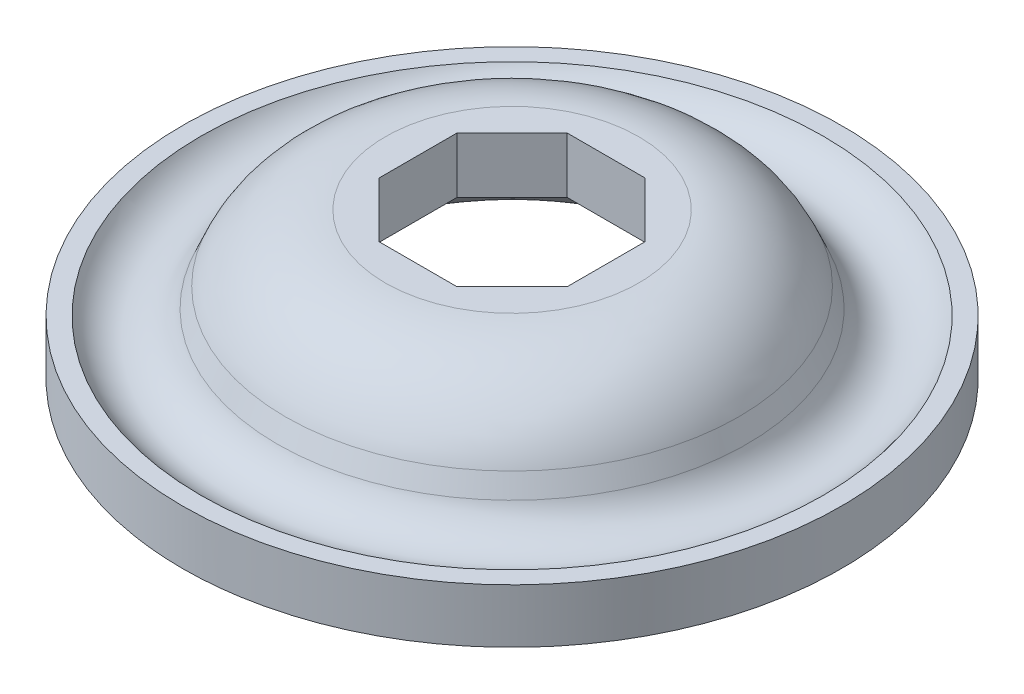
ISO-10303-21;
HEADER;
FILE_DESCRIPTION(('STEP AP214'),'2;1');
FILE_NAME('part.step','',(''),(''),'','','');
FILE_SCHEMA(('AUTOMOTIVE_DESIGN { 1 0 10303 214 1 1 1 1 }'));
ENDSEC;
DATA;
#1=APPLICATION_CONTEXT('core data for automotive mechanical design processes');
#2=APPLICATION_PROTOCOL_DEFINITION('international standard','automotive_design',2000,#1);
#3=PRODUCT_CONTEXT('',#1,'mechanical');
#4=PRODUCT('Part','Part','',(#3));
#5=PRODUCT_RELATED_PRODUCT_CATEGORY('part','',(#4));
#6=PRODUCT_DEFINITION_FORMATION('','',#4);
#7=PRODUCT_DEFINITION_CONTEXT('part definition',#1,'design');
#8=PRODUCT_DEFINITION('design','',#6,#7);
#9=PRODUCT_DEFINITION_SHAPE('','',#8);
#10=(LENGTH_UNIT() NAMED_UNIT(*) SI_UNIT(.MILLI.,.METRE.));
#11=(NAMED_UNIT(*) PLANE_ANGLE_UNIT() SI_UNIT($,.RADIAN.));
#12=(NAMED_UNIT(*) SI_UNIT($,.STERADIAN.) SOLID_ANGLE_UNIT());
#13=UNCERTAINTY_MEASURE_WITH_UNIT(LENGTH_MEASURE(1.E-05),#10,'distance_accuracy_value','');
#14=(GEOMETRIC_REPRESENTATION_CONTEXT(3) GLOBAL_UNCERTAINTY_ASSIGNED_CONTEXT((#13)) GLOBAL_UNIT_ASSIGNED_CONTEXT((#10,
#11,#12)) REPRESENTATION_CONTEXT('',''));
#15=CARTESIAN_POINT('',(0.,0.,0.));
#16=DIRECTION('',(0.,0.,1.));
#17=DIRECTION('',(1.,0.,0.));
#18=AXIS2_PLACEMENT_3D('',#15,#16,#17);
#19=CARTESIAN_POINT('',(-10.7949999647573,0.,0.));
#20=DIRECTION('',(0.,1.,0.));
#21=DIRECTION('',(0.,0.,1.));
#22=AXIS2_PLACEMENT_3D('',#19,#20,#21);
#23=PLANE('',#22);
#24=DIRECTION('',(-1.,0.,0.));
#25=VECTOR('',#24,1.);
#26=CARTESIAN_POINT('',(3.31938322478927,0.,-8.0137));
#27=LINE('',#26,#25);
#28=CARTESIAN_POINT('',(3.31938322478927,0.,-8.0137));
#29=VERTEX_POINT('',#28);
#30=CARTESIAN_POINT('',(-3.31938322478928,0.,-8.0137));
#31=VERTEX_POINT('',#30);
#32=EDGE_CURVE('E687',#29,#31,#27,.T.);
#33=ORIENTED_EDGE('',*,*,#32,.F.);
#34=DIRECTION('',(-0.707106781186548,0.,-0.707106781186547));
#35=VECTOR('',#34,1.);
#36=CARTESIAN_POINT('',(8.0137,0.,-3.31938322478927));
#37=LINE('',#36,#35);
#38=CARTESIAN_POINT('',(8.0137,0.,-3.31938322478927));
#39=VERTEX_POINT('',#38);
#40=EDGE_CURVE('E691',#39,#29,#37,.T.);
#41=ORIENTED_EDGE('',*,*,#40,.F.);
#42=DIRECTION('',(0.,0.,-1.));
#43=VECTOR('',#42,1.);
#44=CARTESIAN_POINT('',(8.0137,0.,3.31938322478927));
#45=LINE('',#44,#43);
#46=CARTESIAN_POINT('',(8.0137,0.,3.31938322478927));
#47=VERTEX_POINT('',#46);
#48=EDGE_CURVE('E700',#47,#39,#45,.T.);
#49=ORIENTED_EDGE('',*,*,#48,.F.);
#50=DIRECTION('',(0.707106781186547,0.,-0.707106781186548));
#51=VECTOR('',#50,1.);
#52=CARTESIAN_POINT('',(3.31938322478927,0.,8.0137));
#53=LINE('',#52,#51);
#54=CARTESIAN_POINT('',(3.31938322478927,0.,8.0137));
#55=VERTEX_POINT('',#54);
#56=EDGE_CURVE('E836',#55,#47,#53,.T.);
#57=ORIENTED_EDGE('',*,*,#56,.F.);
#58=DIRECTION('',(1.,0.,0.));
#59=VECTOR('',#58,1.);
#60=CARTESIAN_POINT('',(-3.31938322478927,0.,8.0137));
#61=LINE('',#60,#59);
#62=CARTESIAN_POINT('',(-3.31938322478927,0.,8.0137));
#63=VERTEX_POINT('',#62);
#64=EDGE_CURVE('E833',#63,#55,#61,.T.);
#65=ORIENTED_EDGE('',*,*,#64,.F.);
#66=DIRECTION('',(0.707106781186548,0.,0.707106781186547));
#67=VECTOR('',#66,1.);
#68=CARTESIAN_POINT('',(-8.0137,0.,3.31938322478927));
#69=LINE('',#68,#67);
#70=CARTESIAN_POINT('',(-8.0137,0.,3.31938322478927));
#71=VERTEX_POINT('',#70);
#72=EDGE_CURVE('E829',#71,#63,#69,.T.);
#73=ORIENTED_EDGE('',*,*,#72,.F.);
#74=DIRECTION('',(0.,0.,1.));
#75=VECTOR('',#74,1.);
#76=CARTESIAN_POINT('',(-8.0137,0.,-3.31938322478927));
#77=LINE('',#76,#75);
#78=CARTESIAN_POINT('',(-8.0137,0.,-3.31938322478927));
#79=VERTEX_POINT('',#78);
#80=EDGE_CURVE('E698',#79,#71,#77,.T.);
#81=ORIENTED_EDGE('',*,*,#80,.F.);
#82=DIRECTION('',(-0.707106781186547,0.,0.707106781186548));
#83=VECTOR('',#82,1.);
#84=CARTESIAN_POINT('',(-3.31938322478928,0.,-8.0137));
#85=LINE('',#84,#83);
#86=EDGE_CURVE('E693',#31,#79,#85,.T.);
#87=ORIENTED_EDGE('',*,*,#86,.F.);
#88=EDGE_LOOP('',(#33,#41,#49,#57,#65,#73,#81,#87));
#89=FACE_BOUND('',#88,.T.);
#90=CARTESIAN_POINT('',(0.,0.,0.));
#91=DIRECTION('',(0.,1.,0.));
#92=DIRECTION('',(0.,0.,1.));
#93=AXIS2_PLACEMENT_3D('',#90,#91,#92);
#94=CIRCLE('',#93,10.7949999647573);
#95=CARTESIAN_POINT('',(0.,0.,10.7949999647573));
#96=VERTEX_POINT('',#95);
#97=EDGE_CURVE('E580',#96,#96,#94,.T.);
#98=ORIENTED_EDGE('',*,*,#97,.T.);
#99=EDGE_LOOP('',(#98));
#100=FACE_BOUND('',#99,.T.);
#101=ADVANCED_FACE('F366',(#89,#100),#23,.T.);
#102=CARTESIAN_POINT('',(0.,-9.233020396,0.));
#103=DIRECTION('',(0.,1.,0.));
#104=DIRECTION('',(0.,0.,1.));
#105=AXIS2_PLACEMENT_3D('',#102,#103,#104);
#106=TOROIDAL_SURFACE('',#105,10.7949999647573,9.233020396);
#107=CARTESIAN_POINT('',(0.,-5.62539200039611,0.));
#108=DIRECTION('',(0.,1.,0.));
#109=DIRECTION('',(0.,0.,1.));
#110=AXIS2_PLACEMENT_3D('',#107,#108,#109);
#111=CIRCLE('',#110,19.2940400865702);
#112=CARTESIAN_POINT('',(0.,-5.62539200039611,19.2940400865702));
#113=VERTEX_POINT('',#112);
#114=EDGE_CURVE('E577',#113,#113,#111,.T.);
#115=ORIENTED_EDGE('',*,*,#114,.T.);
#116=EDGE_LOOP('',(#115));
#117=FACE_BOUND('',#116,.T.);
#118=ORIENTED_EDGE('',*,*,#97,.F.);
#119=EDGE_LOOP('',(#118));
#120=FACE_BOUND('',#119,.T.);
#121=ADVANCED_FACE('F676',(#117,#120),#106,.T.);
#122=CARTESIAN_POINT('',(0.,-5.62539200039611,0.));
#123=DIRECTION('',(0.,-1.,0.));
#124=DIRECTION('',(0.,0.,-1.));
#125=AXIS2_PLACEMENT_3D('',#122,#123,#124);
#126=CONICAL_SURFACE('',#125,19.2940400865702,0.401425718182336);
#127=CARTESIAN_POINT('',(0.,-7.28106270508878,0.));
#128=DIRECTION('',(0.,1.,0.));
#129=DIRECTION('',(0.,0.,1.));
#130=AXIS2_PLACEMENT_3D('',#127,#128,#129);
#131=CIRCLE('',#130,19.9968305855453);
#132=CARTESIAN_POINT('',(0.,-7.28106270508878,19.9968305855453));
#133=VERTEX_POINT('',#132);
#134=EDGE_CURVE('E574',#133,#133,#131,.T.);
#135=ORIENTED_EDGE('',*,*,#134,.T.);
#136=EDGE_LOOP('',(#135));
#137=FACE_BOUND('',#136,.T.);
#138=ORIENTED_EDGE('',*,*,#114,.F.);
#139=EDGE_LOOP('',(#138));
#140=FACE_BOUND('',#139,.T.);
#141=ADVANCED_FACE('F681',(#137,#140),#126,.T.);
#142=CARTESIAN_POINT('',(0.,-5.84199999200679,0.));
#143=DIRECTION('',(0.,1.,0.));
#144=DIRECTION('',(0.,0.,1.));
#145=AXIS2_PLACEMENT_3D('',#142,#143,#144);
#146=TOROIDAL_SURFACE('',#145,23.3870499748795,3.683);
#147=CARTESIAN_POINT('',(0.,-7.8105,0.));
#148=DIRECTION('',(0.,1.,0.));
#149=DIRECTION('',(0.,0.,1.));
#150=AXIS2_PLACEMENT_3D('',#147,#148,#149);
#151=CIRCLE('',#150,26.4998456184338);
#152=CARTESIAN_POINT('',(0.,-7.8105,26.4998456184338));
#153=VERTEX_POINT('',#152);
#154=EDGE_CURVE('E571',#153,#153,#151,.T.);
#155=ORIENTED_EDGE('',*,*,#154,.T.);
#156=EDGE_LOOP('',(#155));
#157=FACE_BOUND('',#156,.T.);
#158=ORIENTED_EDGE('',*,*,#134,.F.);
#159=EDGE_LOOP('',(#158));
#160=FACE_BOUND('',#159,.T.);
#161=ADVANCED_FACE('F1169',(#157,#160),#146,.F.);
#162=CARTESIAN_POINT('',(-26.4998456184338,-7.8105,0.));
#163=DIRECTION('',(0.,1.,0.));
#164=DIRECTION('',(0.,0.,1.));
#165=AXIS2_PLACEMENT_3D('',#162,#163,#164);
#166=PLANE('',#165);
#167=CARTESIAN_POINT('',(0.,-7.8105,0.));
#168=DIRECTION('',(0.,1.,0.));
#169=DIRECTION('',(0.,0.,1.));
#170=AXIS2_PLACEMENT_3D('',#167,#168,#169);
#171=CIRCLE('',#170,28.067);
#172=CARTESIAN_POINT('',(0.,-7.8105,28.067));
#173=VERTEX_POINT('',#172);
#174=EDGE_CURVE('E565',#173,#173,#171,.T.);
#175=ORIENTED_EDGE('',*,*,#174,.T.);
#176=EDGE_LOOP('',(#175));
#177=FACE_BOUND('',#176,.T.);
#178=ORIENTED_EDGE('',*,*,#154,.F.);
#179=EDGE_LOOP('',(#178));
#180=FACE_BOUND('',#179,.T.);
#181=ADVANCED_FACE('F1030',(#177,#180),#166,.T.);
#182=CARTESIAN_POINT('',(0.,0.,0.));
#183=DIRECTION('',(0.,1.,0.));
#184=DIRECTION('',(0.,0.,1.));
#185=AXIS2_PLACEMENT_3D('',#182,#183,#184);
#186=CYLINDRICAL_SURFACE('',#185,28.067);
#187=CARTESIAN_POINT('',(0.,-12.4222432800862,0.));
#188=DIRECTION('',(0.,1.,0.));
#189=DIRECTION('',(0.,0.,1.));
#190=AXIS2_PLACEMENT_3D('',#187,#188,#189);
#191=CIRCLE('',#190,28.067);
#192=CARTESIAN_POINT('',(4.5085,-12.4222432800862,-27.7025254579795));
#193=VERTEX_POINT('',#192);
#194=CARTESIAN_POINT('',(-4.5085,-12.4222432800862,-27.7025254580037));
#195=VERTEX_POINT('',#194);
#196=EDGE_CURVE('E562',#193,#195,#191,.T.);
#197=ORIENTED_EDGE('',*,*,#196,.T.);
#198=CARTESIAN_POINT('',(-16.4006526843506,-12.4222432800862,-22.7766345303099));
#199=VERTEX_POINT('',#198);
#200=EDGE_CURVE('E561',#195,#199,#191,.T.);
#201=ORIENTED_EDGE('',*,*,#200,.T.);
#202=CARTESIAN_POINT('',(-22.7766345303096,-12.4222432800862,-16.400652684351));
#203=VERTEX_POINT('',#202);
#204=EDGE_CURVE('E543',#199,#203,#191,.T.);
#205=ORIENTED_EDGE('',*,*,#204,.T.);
#206=CARTESIAN_POINT('',(-27.7025254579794,-12.4222432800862,-4.50850000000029));
#207=VERTEX_POINT('',#206);
#208=EDGE_CURVE('E548',#203,#207,#191,.T.);
#209=ORIENTED_EDGE('',*,*,#208,.T.);
#210=CARTESIAN_POINT('',(-27.7025254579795,-12.4222432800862,4.50849999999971));
#211=VERTEX_POINT('',#210);
#212=EDGE_CURVE('E555',#207,#211,#191,.T.);
#213=ORIENTED_EDGE('',*,*,#212,.T.);
#214=CARTESIAN_POINT('',(-22.7766345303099,-12.4222432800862,16.4006526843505));
#215=VERTEX_POINT('',#214);
#216=EDGE_CURVE('E760',#211,#215,#191,.T.);
#217=ORIENTED_EDGE('',*,*,#216,.T.);
#218=CARTESIAN_POINT('',(-16.4006526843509,-12.4222432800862,22.7766345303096));
#219=VERTEX_POINT('',#218);
#220=EDGE_CURVE('E757',#215,#219,#191,.T.);
#221=ORIENTED_EDGE('',*,*,#220,.T.);
#222=CARTESIAN_POINT('',(-4.50850000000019,-12.4222432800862,27.7025254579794));
#223=VERTEX_POINT('',#222);
#224=EDGE_CURVE('E753',#219,#223,#191,.T.);
#225=ORIENTED_EDGE('',*,*,#224,.T.);
#226=CARTESIAN_POINT('',(4.50849999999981,-12.4222432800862,27.7025254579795));
#227=VERTEX_POINT('',#226);
#228=EDGE_CURVE('E751',#223,#227,#191,.T.);
#229=ORIENTED_EDGE('',*,*,#228,.T.);
#230=CARTESIAN_POINT('',(16.4006526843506,-12.4222432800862,22.7766345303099));
#231=VERTEX_POINT('',#230);
#232=EDGE_CURVE('E748',#227,#231,#191,.T.);
#233=ORIENTED_EDGE('',*,*,#232,.T.);
#234=CARTESIAN_POINT('',(22.7766345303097,-12.4222432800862,16.4006526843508));
#235=VERTEX_POINT('',#234);
#236=EDGE_CURVE('E745',#231,#235,#191,.T.);
#237=ORIENTED_EDGE('',*,*,#236,.T.);
#238=CARTESIAN_POINT('',(27.7025254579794,-12.4222432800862,4.5085000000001));
#239=VERTEX_POINT('',#238);
#240=EDGE_CURVE('E741',#235,#239,#191,.T.);
#241=ORIENTED_EDGE('',*,*,#240,.T.);
#242=CARTESIAN_POINT('',(27.7025254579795,-12.4222432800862,-4.5084999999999));
#243=VERTEX_POINT('',#242);
#244=EDGE_CURVE('E739',#239,#243,#191,.T.);
#245=ORIENTED_EDGE('',*,*,#244,.T.);
#246=CARTESIAN_POINT('',(22.7766345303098,-12.4222432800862,-16.4006526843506));
#247=VERTEX_POINT('',#246);
#248=EDGE_CURVE('E736',#243,#247,#191,.T.);
#249=ORIENTED_EDGE('',*,*,#248,.T.);
#250=CARTESIAN_POINT('',(16.4006526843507,-12.4222432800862,-22.7766345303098));
#251=VERTEX_POINT('',#250);
#252=EDGE_CURVE('E732',#247,#251,#191,.T.);
#253=ORIENTED_EDGE('',*,*,#252,.T.);
#254=EDGE_CURVE('E566',#251,#193,#191,.T.);
#255=ORIENTED_EDGE('',*,*,#254,.T.);
#256=EDGE_LOOP('',(#197,#201,#205,#209,#213,#217,#221,#225,#229,#233,#237,#241,#245,#249,#253,#255));
#257=FACE_BOUND('',#256,.T.);
#258=ORIENTED_EDGE('',*,*,#174,.F.);
#259=EDGE_LOOP('',(#258));
#260=FACE_BOUND('',#259,.T.);
#261=ADVANCED_FACE('F558',(#257,#260),#186,.T.);
#262=CARTESIAN_POINT('',(0.,-4.4224425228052,0.));
#263=DIRECTION('',(0.,1.,0.));
#264=DIRECTION('',(0.,0.,1.));
#265=AXIS2_PLACEMENT_3D('',#262,#263,#264);
#266=TOROIDAL_SURFACE('',#265,23.3870501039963,9.268157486);
#267=CARTESIAN_POINT('',(24.7742454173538,-9.16387535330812,-19.2118360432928));
#268=CARTESIAN_POINT('',(24.7025851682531,-9.39122264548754,-19.0834101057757));
#269=CARTESIAN_POINT('',(24.6232401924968,-9.61263417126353,-18.9487815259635));
#270=CARTESIAN_POINT('',(24.4498250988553,-10.0421781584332,-18.6681148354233));
#271=CARTESIAN_POINT('',(24.3557498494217,-10.2503059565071,-18.5220727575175));
#272=CARTESIAN_POINT('',(24.154141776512,-10.6505779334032,-18.2205219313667));
#273=CARTESIAN_POINT('',(24.0466881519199,-10.8428059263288,-18.0650714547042));
#274=CARTESIAN_POINT('',(23.818737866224,-11.2111759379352,-17.7451439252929));
#275=CARTESIAN_POINT('',(23.6982471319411,-11.3873251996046,-17.580670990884));
#276=CARTESIAN_POINT('',(23.4499716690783,-11.7158873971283,-17.2503577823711));
#277=CARTESIAN_POINT('',(23.3226533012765,-11.8689573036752,-17.0848198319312));
#278=CARTESIAN_POINT('',(23.0574471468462,-12.1583384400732,-16.7473589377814));
#279=CARTESIAN_POINT('',(22.9195509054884,-12.2946360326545,-16.5754309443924));
#280=CARTESIAN_POINT('',(22.6280823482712,-12.5548826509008,-16.2189821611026));
#281=CARTESIAN_POINT('',(22.4740923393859,-12.6780574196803,-16.0342370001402));
#282=CARTESIAN_POINT('',(22.1567126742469,-12.9042363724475,-15.6603833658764));
#283=CARTESIAN_POINT('',(21.9933195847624,-13.0072331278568,-15.4712733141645));
#284=CARTESIAN_POINT('',(21.6581359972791,-13.1923588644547,-15.0898662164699));
#285=CARTESIAN_POINT('',(21.4863361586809,-13.2744639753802,-14.8975657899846));
#286=CARTESIAN_POINT('',(21.1357148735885,-13.4170345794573,-14.5113464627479));
#287=CARTESIAN_POINT('',(20.9568933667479,-13.4774998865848,-14.3174275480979));
#288=CARTESIAN_POINT('',(20.5935753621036,-13.5762813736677,-13.9294450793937));
#289=CARTESIAN_POINT('',(20.4090816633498,-13.6146082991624,-13.7353816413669));
#290=CARTESIAN_POINT('',(20.0356370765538,-13.6688113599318,-13.3484032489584));
#291=CARTESIAN_POINT('',(19.8466861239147,-13.6846871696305,-13.1554883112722));
#292=CARTESIAN_POINT('',(19.4655956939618,-13.6937792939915,-12.7721276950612));
#293=CARTESIAN_POINT('',(19.2734549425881,-13.6869863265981,-12.5816830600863));
#294=CARTESIAN_POINT('',(18.8874495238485,-13.6506550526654,-12.2047490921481));
#295=CARTESIAN_POINT('',(18.693584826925,-13.6211163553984,-12.0182598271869));
#296=CARTESIAN_POINT('',(18.2888832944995,-13.5358568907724,-11.6348464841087));
#297=CARTESIAN_POINT('',(18.0780176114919,-13.4781068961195,-11.4384002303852));
#298=CARTESIAN_POINT('',(17.6578953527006,-13.3362141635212,-11.0537067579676));
#299=CARTESIAN_POINT('',(17.4486380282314,-13.2520845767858,-10.8654555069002));
#300=CARTESIAN_POINT('',(17.0338103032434,-13.0580903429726,-10.4990656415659));
#301=CARTESIAN_POINT('',(16.8282350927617,-12.9482623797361,-10.3209130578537));
#302=CARTESIAN_POINT('',(16.422478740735,-12.7036208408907,-9.97624054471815));
#303=CARTESIAN_POINT('',(16.2222944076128,-12.5688224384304,-9.80971363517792));
#304=CARTESIAN_POINT('',(15.8733528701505,-12.3082550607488,-9.52583241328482));
#305=CARTESIAN_POINT('',(15.7231498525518,-12.1872665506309,-9.40583866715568));
#306=CARTESIAN_POINT('',(15.4281017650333,-11.93158386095,-9.17463125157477));
#307=CARTESIAN_POINT('',(15.2832510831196,-11.7969046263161,-9.0634082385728));
#308=CARTESIAN_POINT('',(14.9815638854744,-11.496428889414,-8.83674595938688));
#309=CARTESIAN_POINT('',(14.8255456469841,-11.32885325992,-8.72256919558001));
#310=CARTESIAN_POINT('',(14.522350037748,-10.978049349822,-8.50696480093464));
#311=CARTESIAN_POINT('',(14.3751769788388,-10.7948135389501,-8.40554336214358));
#312=CARTESIAN_POINT('',(14.0899145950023,-10.4127095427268,-8.21568742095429));
#313=CARTESIAN_POINT('',(13.951895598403,-10.2137414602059,-8.12734818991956));
#314=CARTESIAN_POINT('',(13.6871762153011,-9.80287294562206,-7.96521737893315));
#315=CARTESIAN_POINT('',(13.5604723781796,-9.59097648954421,-7.89142135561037));
#316=CARTESIAN_POINT('',(13.4399360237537,-9.37334182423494,-7.82522557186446));
#317=B_SPLINE_CURVE_WITH_KNOTS('',3,(#267,#268,#269,#270,#271,#272,#273,#274,#275,#276,#277,
#278,#279,#280,#281,#282,#283,#284,#285,#286,#287,#288,#289,#290,#291,#292,#293,#294,#295,#296,
#297,#298,#299,#300,#301,#302,#303,#304,#305,#306,#307,#308,#309,#310,#311,#312,#313,#314,#315,
#316),.UNSPECIFIED.,.F.,.F.,(4,2,2,2,2,2,2,2,2,2,2,2,2,2,2,2,2,2,2,2,2,2,2,2,4),(0.,
0.812050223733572,1.62438397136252,2.43211905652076,3.23948846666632,4.0154368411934,
4.79201201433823,5.60169717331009,6.41167986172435,7.22258390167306,8.03349491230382,
8.84401199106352,9.65454082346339,10.4654015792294,11.2762762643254,12.1567339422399,
13.0367533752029,13.9155241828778,14.7937627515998,15.4746033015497,16.1547084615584,
16.9213015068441,17.6882652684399,18.4605654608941,19.2326293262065),.UNSPECIFIED.);
#318=CARTESIAN_POINT('',(16.0260013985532,-12.4222432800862,-9.65001955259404));
#319=VERTEX_POINT('',#318);
#320=EDGE_CURVE('E11',#247,#319,#317,.T.);
#321=ORIENTED_EDGE('',*,*,#320,.F.);
#322=ORIENTED_EDGE('',*,*,#248,.F.);
#323=CARTESIAN_POINT('',(18.1553450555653,-12.4220432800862,-4.50846468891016));
#324=CARTESIAN_POINT('',(18.3810806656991,-12.5535244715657,-4.53167840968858));
#325=CARTESIAN_POINT('',(18.6126001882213,-12.6753299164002,-4.55318382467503));
#326=CARTESIAN_POINT('',(19.0853286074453,-12.8989621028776,-4.59266730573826));
#327=CARTESIAN_POINT('',(19.326535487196,-13.0007929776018,-4.61064610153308));
#328=CARTESIAN_POINT('',(19.8163545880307,-13.1837168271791,-4.64294230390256));
#329=CARTESIAN_POINT('',(20.0649506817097,-13.2648517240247,-4.65726711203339));
#330=CARTESIAN_POINT('',(20.5681935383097,-13.4062508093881,-4.68223189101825));
#331=CARTESIAN_POINT('',(20.8228404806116,-13.4665143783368,-4.69287175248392));
#332=CARTESIAN_POINT('',(21.3362373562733,-13.5658704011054,-4.71041359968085));
#333=CARTESIAN_POINT('',(21.5949854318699,-13.6049721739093,-4.7173172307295));
#334=CARTESIAN_POINT('',(22.1148894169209,-13.6619102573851,-4.72736995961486));
#335=CARTESIAN_POINT('',(22.3760454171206,-13.6797457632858,-4.73051891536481));
#336=CARTESIAN_POINT('',(22.8991534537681,-13.6941472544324,-4.73306157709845));
#337=CARTESIAN_POINT('',(23.1611059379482,-13.6906974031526,-4.73245248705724));
#338=CARTESIAN_POINT('',(23.683827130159,-13.6626118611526,-4.72749383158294));
#339=CARTESIAN_POINT('',(23.9445958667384,-13.6379766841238,-4.72314435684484));
#340=CARTESIAN_POINT('',(24.46848332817,-13.5670502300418,-4.71062190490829));
#341=CARTESIAN_POINT('',(24.7315420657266,-13.5203289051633,-4.70237300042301));
#342=CARTESIAN_POINT('',(25.2527892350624,-13.4054717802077,-4.6820943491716));
#343=CARTESIAN_POINT('',(25.5109777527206,-13.3373363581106,-4.67006466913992));
#344=CARTESIAN_POINT('',(26.0202640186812,-13.1803103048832,-4.64234086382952));
#345=CARTESIAN_POINT('',(26.271373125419,-13.0914553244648,-4.62665303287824));
#346=CARTESIAN_POINT('',(26.7651451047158,-12.8935995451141,-4.59172051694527));
#347=CARTESIAN_POINT('',(27.0078128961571,-12.784610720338,-4.57247794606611));
#348=CARTESIAN_POINT('',(27.3227981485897,-12.6273217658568,-4.54470772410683));
#349=CARTESIAN_POINT('',(27.3996467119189,-12.5876542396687,-4.53770420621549));
#350=CARTESIAN_POINT('',(27.5521469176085,-12.5063372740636,-4.52334725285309));
#351=CARTESIAN_POINT('',(27.6277997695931,-12.4646900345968,-4.51599420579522));
#352=CARTESIAN_POINT('',(27.7028775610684,-12.4220432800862,-4.50846468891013));
#353=B_SPLINE_CURVE_WITH_KNOTS('',3,(#323,#324,#325,#326,#327,#328,#329,#330,#331,#332,#333,
#334,#335,#336,#337,#338,#339,#340,#341,#342,#343,#344,#345,#346,#347,#348,#349,#350,#351,#352),
.UNSPECIFIED.,.F.,.F.,(4,2,2,2,2,2,2,2,2,2,2,2,2,2,4),(0.,0.78651489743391,1.57286687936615,
2.35761313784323,3.14238268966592,3.92680637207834,4.71125973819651,5.49629681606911,
6.28131485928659,7.0822908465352,7.8832526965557,8.68284642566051,9.48196613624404,
9.74224036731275,10.0022318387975),.UNSPECIFIED.);
#354=CARTESIAN_POINT('',(18.1556885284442,-12.4222432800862,-4.50849999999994));
#355=VERTEX_POINT('',#354);
#356=EDGE_CURVE('E886',#355,#243,#353,.T.);
#357=ORIENTED_EDGE('',*,*,#356,.F.);
#358=CARTESIAN_POINT('',(0.,-12.4222432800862,0.));
#359=DIRECTION('',(0.,-1.,0.));
#360=DIRECTION('',(0.,0.,-1.));
#361=AXIS2_PLACEMENT_3D('',#358,#359,#360);
#362=CIRCLE('',#361,18.7071002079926);
#363=CARTESIAN_POINT('',(18.1556885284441,-12.4222432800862,4.50850000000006));
#364=VERTEX_POINT('',#363);
#365=EDGE_CURVE('E897',#364,#355,#362,.F.);
#366=ORIENTED_EDGE('',*,*,#365,.F.);
#367=CARTESIAN_POINT('',(27.7028775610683,-12.4220432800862,4.50846468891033));
#368=CARTESIAN_POINT('',(27.4687441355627,-12.5550710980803,4.53195147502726));
#369=CARTESIAN_POINT('',(27.2289132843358,-12.6783674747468,4.55372012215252));
#370=CARTESIAN_POINT('',(26.7396011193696,-12.9047181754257,4.59368357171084));
#371=CARTESIAN_POINT('',(26.4901199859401,-13.0077728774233,4.61187844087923));
#372=CARTESIAN_POINT('',(25.9834284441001,-13.1927982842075,4.64454568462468));
#373=CARTESIAN_POINT('',(25.7262238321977,-13.2747843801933,4.65902077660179));
#374=CARTESIAN_POINT('',(25.2057260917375,-13.4171608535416,4.68415811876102));
#375=CARTESIAN_POINT('',(24.942433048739,-13.4775515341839,4.69482042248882));
#376=CARTESIAN_POINT('',(24.411414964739,-13.5762902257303,4.71225327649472));
#377=CARTESIAN_POINT('',(24.1436867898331,-13.6146219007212,4.71902094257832));
#378=CARTESIAN_POINT('',(23.6057728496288,-13.6688383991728,4.7285931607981));
#379=CARTESIAN_POINT('',(23.3355860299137,-13.6847130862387,4.73139592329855));
#380=CARTESIAN_POINT('',(22.7949154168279,-13.6937713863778,4.73299521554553));
#381=CARTESIAN_POINT('',(22.5244317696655,-13.6869633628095,4.73179322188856));
#382=CARTESIAN_POINT('',(21.9851674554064,-13.6506181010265,4.7253762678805));
#383=CARTESIAN_POINT('',(21.7163860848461,-13.6210909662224,4.72016309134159));
#384=CARTESIAN_POINT('',(21.1602035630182,-13.5359991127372,4.70513966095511));
#385=CARTESIAN_POINT('',(20.8731087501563,-13.4784765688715,4.69498374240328));
#386=CARTESIAN_POINT('',(20.3056490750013,-13.3371725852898,4.67003575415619));
#387=CARTESIAN_POINT('',(20.025284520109,-13.2533899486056,4.65524347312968));
#388=CARTESIAN_POINT('',(19.4728067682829,-13.0597045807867,4.62104726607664));
#389=CARTESIAN_POINT('',(19.2007288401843,-12.9497041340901,4.60162608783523));
#390=CARTESIAN_POINT('',(18.668459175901,-12.7045421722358,4.55834140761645));
#391=CARTESIAN_POINT('',(18.4082700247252,-12.5693752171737,4.53447694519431));
#392=CARTESIAN_POINT('',(18.1553450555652,-12.4220432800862,4.50846468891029));
#393=B_SPLINE_CURVE_WITH_KNOTS('',3,(#367,#368,#369,#370,#371,#372,#373,#374,#375,#376,#377,
#378,#379,#380,#381,#382,#383,#384,#385,#386,#387,#388,#389,#390,#391,#392),.UNSPECIFIED.,.F.,
.F.,(4,2,2,2,2,2,2,2,2,2,2,2,4),(0.,0.810681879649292,1.6213486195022,2.43142145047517,
3.24148290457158,4.05214348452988,4.8631698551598,5.6738972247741,6.48426426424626,
7.36189629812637,8.23956834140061,9.12056413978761,10.0017505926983),.UNSPECIFIED.);
#394=EDGE_CURVE('E898',#239,#364,#393,.T.);
#395=ORIENTED_EDGE('',*,*,#394,.F.);
#396=ORIENTED_EDGE('',*,*,#240,.F.);
#397=CARTESIAN_POINT('',(13.0265040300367,-8.55234817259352,7.61678511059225));
#398=CARTESIAN_POINT('',(13.128525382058,-8.77615774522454,7.66292409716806));
#399=CARTESIAN_POINT('',(13.2368469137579,-8.99556388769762,7.71646274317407));
#400=CARTESIAN_POINT('',(13.4652715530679,-9.42404752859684,7.83790054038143));
#401=CARTESIAN_POINT('',(13.5853755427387,-9.63312425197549,7.90580076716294));
#402=CARTESIAN_POINT('',(13.8361126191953,-10.0387168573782,8.05526659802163));
#403=CARTESIAN_POINT('',(13.9667093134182,-10.2352722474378,8.13678594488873));
#404=CARTESIAN_POINT('',(14.2377563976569,-10.6151370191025,8.31298569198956));
#405=CARTESIAN_POINT('',(14.3782049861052,-10.7984488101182,8.40766368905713));
#406=CARTESIAN_POINT('',(14.7539654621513,-11.2551479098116,8.66939228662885));
#407=CARTESIAN_POINT('',(14.9961526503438,-11.5175062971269,8.84607196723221));
#408=CARTESIAN_POINT('',(15.4986252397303,-12.0013383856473,9.22773792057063));
#409=CARTESIAN_POINT('',(15.7589192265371,-12.2227925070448,9.43273766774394));
#410=CARTESIAN_POINT('',(16.2015071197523,-12.5533069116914,9.79280037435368));
#411=CARTESIAN_POINT('',(16.3801105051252,-12.6749343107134,9.94103496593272));
#412=CARTESIAN_POINT('',(16.7417568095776,-12.8983157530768,10.2469058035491));
#413=CARTESIAN_POINT('',(16.9248005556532,-13.0000660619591,10.4045438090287));
#414=CARTESIAN_POINT('',(17.2939823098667,-13.1831078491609,10.7280223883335));
#415=CARTESIAN_POINT('',(17.4801216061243,-13.2643905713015,10.8938664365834));
#416=CARTESIAN_POINT('',(17.8541465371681,-13.4060580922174,11.2325188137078));
#417=CARTESIAN_POINT('',(18.0420328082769,-13.466434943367,11.4053297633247));
#418=CARTESIAN_POINT('',(18.4177599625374,-13.5658694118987,11.7562294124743));
#419=CARTESIAN_POINT('',(18.6056001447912,-13.6049706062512,11.9343065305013));
#420=CARTESIAN_POINT('',(18.9804051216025,-13.6619200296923,12.2948919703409));
#421=CARTESIAN_POINT('',(19.1673694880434,-13.6797587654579,12.4774022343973));
#422=CARTESIAN_POINT('',(19.5391342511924,-13.6941474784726,12.8455743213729));
#423=CARTESIAN_POINT('',(19.7239338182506,-13.6906895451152,13.0312372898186));
#424=CARTESIAN_POINT('',(20.0899770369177,-13.6625929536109,13.4042958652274));
#425=CARTESIAN_POINT('',(20.271222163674,-13.6379632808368,13.5916907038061));
#426=CARTESIAN_POINT('',(20.632798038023,-13.5670394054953,13.9709753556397));
#427=CARTESIAN_POINT('',(20.8130294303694,-13.5203005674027,14.1628768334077));
#428=CARTESIAN_POINT('',(21.1673098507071,-13.4054160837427,14.5458424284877));
#429=CARTESIAN_POINT('',(21.3413610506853,-13.3372780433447,14.7369068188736));
#430=CARTESIAN_POINT('',(21.6818364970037,-13.1802570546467,15.1165883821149));
#431=CARTESIAN_POINT('',(21.8482743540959,-13.0914130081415,15.3052094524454));
#432=CARTESIAN_POINT('',(22.1726695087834,-12.8935883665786,15.6789988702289));
#433=CARTESIAN_POINT('',(22.330630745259,-12.7846172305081,15.864168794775));
#434=CARTESIAN_POINT('',(22.5835737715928,-12.588718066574,16.1660253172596));
#435=CARTESIAN_POINT('',(22.6812971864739,-12.5073679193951,16.2840608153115));
#436=CARTESIAN_POINT('',(22.7941352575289,-12.4066172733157,16.4220550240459));
#437=CARTESIAN_POINT('',(22.8113413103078,-12.3910613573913,16.4431451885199));
#438=CARTESIAN_POINT('',(22.9759655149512,-12.2403616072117,16.645397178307));
#439=CARTESIAN_POINT('',(23.1182520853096,-12.0956797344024,16.8238089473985));
#440=CARTESIAN_POINT('',(23.3913629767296,-11.7880198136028,17.1737385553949));
#441=CARTESIAN_POINT('',(23.5221776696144,-11.6250266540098,17.3452505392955));
#442=CARTESIAN_POINT('',(23.7720909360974,-11.2808746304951,17.6810941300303));
#443=CARTESIAN_POINT('',(23.8911123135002,-11.0996099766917,17.8453749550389));
#444=CARTESIAN_POINT('',(24.1155783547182,-10.7212116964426,18.164322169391));
#445=CARTESIAN_POINT('',(24.2210329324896,-10.524089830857,18.3189955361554));
#446=CARTESIAN_POINT('',(24.3193233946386,-10.3196300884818,18.4683369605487));
#447=B_SPLINE_CURVE_WITH_KNOTS('',3,(#397,#398,#399,#400,#401,#402,#403,#404,#405,#406,#407,
#408,#409,#410,#411,#412,#413,#414,#415,#416,#417,#418,#419,#420,#421,#422,#423,#424,#425,#426,
#427,#428,#429,#430,#431,#432,#433,#434,#435,#436,#437,#438,#439,#440,#441,#442,#443,#444,#445,
#446),.UNSPECIFIED.,.F.,.F.,(4,2,2,2,2,2,2,2,2,2,2,2,2,2,2,2,2,2,2,2,2,2,2,2,4),(0.,
0.750532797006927,1.50112182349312,2.24921146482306,2.99716466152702,4.18855008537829,
5.38050432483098,6.16574716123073,6.95113738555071,7.73686303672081,8.52288706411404,
9.30729503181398,10.0920530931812,10.8771026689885,11.6618192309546,12.4630354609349,
13.2639672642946,14.0634062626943,14.862470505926,15.3826889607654,15.4767402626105,
16.2862411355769,17.0964150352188,17.911583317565,18.7261524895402),.UNSPECIFIED.);
#448=CARTESIAN_POINT('',(16.0260013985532,-12.4222432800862,9.65001955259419));
#449=VERTEX_POINT('',#448);
#450=EDGE_CURVE('E880',#449,#235,#447,.T.);
#451=ORIENTED_EDGE('',*,*,#450,.F.);
#452=CARTESIAN_POINT('',(9.65001955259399,-12.4222432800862,16.0260013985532));
#453=VERTEX_POINT('',#452);
#454=EDGE_CURVE('E887',#453,#449,#362,.F.);
#455=ORIENTED_EDGE('',*,*,#454,.F.);
#456=CARTESIAN_POINT('',(18.4683369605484,-10.3196300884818,24.3193233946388));
#457=CARTESIAN_POINT('',(18.3150193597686,-10.5295339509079,24.2184160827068));
#458=CARTESIAN_POINT('',(18.156087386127,-10.7316973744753,24.1099617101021));
#459=CARTESIAN_POINT('',(17.8282681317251,-11.1191332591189,23.8788802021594));
#460=CARTESIAN_POINT('',(17.6593812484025,-11.3044063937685,23.7562536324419));
#461=CARTESIAN_POINT('',(17.3130577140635,-11.6565216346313,23.4978487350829));
#462=CARTESIAN_POINT('',(17.1356283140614,-11.8233789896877,23.3620814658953));
#463=CARTESIAN_POINT('',(16.7734331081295,-12.1376034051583,23.0783440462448));
#464=CARTESIAN_POINT('',(16.5886675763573,-12.2849711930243,22.9303743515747));
#465=CARTESIAN_POINT('',(16.2187941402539,-12.5550205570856,22.6279287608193));
#466=CARTESIAN_POINT('',(16.0338613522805,-12.6783080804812,22.4737792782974));
#467=CARTESIAN_POINT('',(15.659690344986,-12.9046321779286,22.1561184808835));
#468=CARTESIAN_POINT('',(15.470452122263,-13.0076687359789,21.9926071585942));
#469=CARTESIAN_POINT('',(15.0890692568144,-13.1927084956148,21.6574263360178));
#470=CARTESIAN_POINT('',(14.8969256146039,-13.2747187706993,21.4857596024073));
#471=CARTESIAN_POINT('',(14.5110241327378,-13.4171350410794,21.1354176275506));
#472=CARTESIAN_POINT('',(14.3172662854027,-13.4775409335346,20.9567423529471));
#473=CARTESIAN_POINT('',(13.9295016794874,-13.5762669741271,20.5936283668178));
#474=CARTESIAN_POINT('',(13.7354949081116,-13.6145859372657,20.4091893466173));
#475=CARTESIAN_POINT('',(13.3485486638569,-13.6687974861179,20.0357790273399));
#476=CARTESIAN_POINT('',(13.1556096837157,-13.6846804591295,19.8468058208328));
#477=CARTESIAN_POINT('',(12.7721649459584,-13.6937822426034,19.4656336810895));
#478=CARTESIAN_POINT('',(12.581660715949,-13.6869874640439,19.2734328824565));
#479=CARTESIAN_POINT('',(12.2046958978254,-13.6506466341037,18.8873942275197));
#480=CARTESIAN_POINT('',(12.0182335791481,-13.6211105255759,18.6935571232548));
#481=CARTESIAN_POINT('',(11.635060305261,-13.5359044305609,18.2891089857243));
#482=CARTESIAN_POINT('',(11.438821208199,-13.4782306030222,18.0784694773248));
#483=CARTESIAN_POINT('',(11.054407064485,-13.3365039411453,17.6586680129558));
#484=CARTESIAN_POINT('',(10.8662328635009,-13.2524483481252,17.4495062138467));
#485=CARTESIAN_POINT('',(10.499796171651,-13.0585247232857,17.0346492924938));
#486=CARTESIAN_POINT('',(10.3215297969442,-12.9486668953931,16.8289528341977));
#487=CARTESIAN_POINT('',(9.97657068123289,-12.7038882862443,16.4228756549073));
#488=CARTESIAN_POINT('',(9.80987591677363,-12.5689719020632,16.2224940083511));
#489=CARTESIAN_POINT('',(9.51305189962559,-12.2965237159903,15.8576431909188));
#490=CARTESIAN_POINT('',(9.38113385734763,-12.1622374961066,15.6921956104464));
#491=CARTESIAN_POINT('',(9.12793265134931,-11.876904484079,15.3677504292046));
#492=CARTESIAN_POINT('',(9.0066485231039,-11.7258592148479,15.2087522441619));
#493=CARTESIAN_POINT('',(8.77573137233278,-11.40805748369,14.8984840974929));
#494=CARTESIAN_POINT('',(8.66608968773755,-11.2413128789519,14.7472084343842));
#495=CARTESIAN_POINT('',(8.45921394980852,-10.8931032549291,14.4533892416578));
#496=CARTESIAN_POINT('',(8.3619783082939,-10.7116401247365,14.3108445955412));
#497=CARTESIAN_POINT('',(8.19946108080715,-10.3742536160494,14.0640863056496));
#498=CARTESIAN_POINT('',(8.1317330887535,-10.2208287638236,13.9580501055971));
#499=CARTESIAN_POINT('',(8.00487215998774,-9.90619635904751,13.7526295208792));
#500=CARTESIAN_POINT('',(7.94573792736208,-9.74498998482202,13.6532441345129));
#501=CARTESIAN_POINT('',(7.83633081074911,-9.41549812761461,13.4615671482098));
#502=CARTESIAN_POINT('',(7.78605842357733,-9.24721224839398,13.3692759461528));
#503=CARTESIAN_POINT('',(7.69457271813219,-8.9043198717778,13.19217443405));
#504=CARTESIAN_POINT('',(7.65336096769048,-8.72971228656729,13.1073654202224));
#505=CARTESIAN_POINT('',(7.61678511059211,-8.5523481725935,13.0265040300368));
#506=B_SPLINE_CURVE_WITH_KNOTS('',3,(#456,#457,#458,#459,#460,#461,#462,#463,#464,#465,#466,
#467,#468,#469,#470,#471,#472,#473,#474,#475,#476,#477,#478,#479,#480,#481,#482,#483,#484,#485,
#486,#487,#488,#489,#490,#491,#492,#493,#494,#495,#496,#497,#498,#499,#500,#501,#502,#503,#504,
#505),.UNSPECIFIED.,.F.,.F.,(4,2,2,2,2,2,2,2,2,2,2,2,2,2,2,2,2,2,2,2,2,2,2,2,4),(0.,
0.836226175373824,1.67241898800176,2.50791412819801,3.34337807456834,4.15388386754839,
4.96439030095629,5.77462371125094,6.58486097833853,7.39514171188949,8.20576950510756,
9.01688313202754,9.82764232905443,10.7071571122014,11.5867638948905,12.4660234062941,
13.3451287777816,14.0961391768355,14.8470813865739,15.597460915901,16.3477442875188,
16.9425717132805,17.5373093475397,18.1320803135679,18.72695411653),.UNSPECIFIED.);
#507=EDGE_CURVE('E888',#231,#453,#506,.T.);
#508=ORIENTED_EDGE('',*,*,#507,.F.);
#509=ORIENTED_EDGE('',*,*,#232,.F.);
#510=CARTESIAN_POINT('',(4.5084646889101,-12.4220432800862,18.1553450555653));
#511=CARTESIAN_POINT('',(4.53167840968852,-12.5535244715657,18.3810806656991));
#512=CARTESIAN_POINT('',(4.55318382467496,-12.6753299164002,18.6126001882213));
#513=CARTESIAN_POINT('',(4.5926673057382,-12.8989621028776,19.0853286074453));
#514=CARTESIAN_POINT('',(4.61064610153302,-13.0007929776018,19.326535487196));
#515=CARTESIAN_POINT('',(4.64294230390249,-13.1837168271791,19.8163545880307));
#516=CARTESIAN_POINT('',(4.65726711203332,-13.2648517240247,20.0649506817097));
#517=CARTESIAN_POINT('',(4.68223189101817,-13.4062508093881,20.5681935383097));
#518=CARTESIAN_POINT('',(4.69287175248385,-13.4665143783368,20.8228404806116));
#519=CARTESIAN_POINT('',(4.71041359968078,-13.5658704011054,21.3362373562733));
#520=CARTESIAN_POINT('',(4.71731723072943,-13.6049721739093,21.5949854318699));
#521=CARTESIAN_POINT('',(4.72736995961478,-13.6619102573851,22.1148894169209));
#522=CARTESIAN_POINT('',(4.73051891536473,-13.6797457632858,22.3760454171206));
#523=CARTESIAN_POINT('',(4.73306157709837,-13.6941472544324,22.8991534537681));
#524=CARTESIAN_POINT('',(4.73245248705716,-13.6906974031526,23.1611059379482));
#525=CARTESIAN_POINT('',(4.72749383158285,-13.6626118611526,23.683827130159));
#526=CARTESIAN_POINT('',(4.72314435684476,-13.6379766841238,23.9445958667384));
#527=CARTESIAN_POINT('',(4.71062190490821,-13.5670502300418,24.46848332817));
#528=CARTESIAN_POINT('',(4.70237300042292,-13.5203289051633,24.7315420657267));
#529=CARTESIAN_POINT('',(4.68209434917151,-13.4054717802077,25.2527892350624));
#530=CARTESIAN_POINT('',(4.67006466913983,-13.3373363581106,25.5109777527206));
#531=CARTESIAN_POINT('',(4.64234086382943,-13.1803103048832,26.0202640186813));
#532=CARTESIAN_POINT('',(4.62665303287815,-13.0914553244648,26.271373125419));
#533=CARTESIAN_POINT('',(4.59172051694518,-12.8935995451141,26.7651451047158));
#534=CARTESIAN_POINT('',(4.57247794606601,-12.784610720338,27.0078128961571));
#535=CARTESIAN_POINT('',(4.54470772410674,-12.6273217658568,27.3227981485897));
#536=CARTESIAN_POINT('',(4.5377042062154,-12.5876542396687,27.3996467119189));
#537=CARTESIAN_POINT('',(4.523347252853,-12.5063372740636,27.5521469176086));
#538=CARTESIAN_POINT('',(4.51599420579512,-12.4646900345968,27.6277997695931));
#539=CARTESIAN_POINT('',(4.50846468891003,-12.4220432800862,27.7028775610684));
#540=B_SPLINE_CURVE_WITH_KNOTS('',3,(#510,#511,#512,#513,#514,#515,#516,#517,#518,#519,#520,
#521,#522,#523,#524,#525,#526,#527,#528,#529,#530,#531,#532,#533,#534,#535,#536,#537,#538,#539),
.UNSPECIFIED.,.F.,.F.,(4,2,2,2,2,2,2,2,2,2,2,2,2,2,4),(0.,0.786514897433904,1.57286687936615,
2.35761313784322,3.14238268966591,3.92680637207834,4.71125973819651,5.49629681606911,
6.28131485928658,7.08229084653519,7.8832526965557,8.68284642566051,9.48196613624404,
9.74224036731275,10.0022318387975),.UNSPECIFIED.);
#541=CARTESIAN_POINT('',(4.50849999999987,-12.4222432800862,18.1556885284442));
#542=VERTEX_POINT('',#541);
#543=EDGE_CURVE('E787',#542,#227,#540,.T.);
#544=ORIENTED_EDGE('',*,*,#543,.F.);
#545=CARTESIAN_POINT('',(-4.50850000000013,-12.4222432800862,18.1556885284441));
#546=VERTEX_POINT('',#545);
#547=EDGE_CURVE('E929',#546,#542,#362,.F.);
#548=ORIENTED_EDGE('',*,*,#547,.F.);
#549=CARTESIAN_POINT('',(-4.50846468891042,-12.4220432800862,27.7028775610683));
#550=CARTESIAN_POINT('',(-4.53195147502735,-12.5550710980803,27.4687441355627));
#551=CARTESIAN_POINT('',(-4.55372012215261,-12.6783674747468,27.2289132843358));
#552=CARTESIAN_POINT('',(-4.59368357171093,-12.9047181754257,26.7396011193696));
#553=CARTESIAN_POINT('',(-4.61187844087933,-13.0077728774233,26.4901199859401));
#554=CARTESIAN_POINT('',(-4.64454568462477,-13.1927982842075,25.9834284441));
#555=CARTESIAN_POINT('',(-4.65902077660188,-13.2747843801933,25.7262238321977));
#556=CARTESIAN_POINT('',(-4.6841581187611,-13.4171608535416,25.2057260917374));
#557=CARTESIAN_POINT('',(-4.69482042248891,-13.4775515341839,24.942433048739));
#558=CARTESIAN_POINT('',(-4.71225327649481,-13.5762902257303,24.411414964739));
#559=CARTESIAN_POINT('',(-4.7190209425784,-13.6146219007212,24.1436867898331));
#560=CARTESIAN_POINT('',(-4.72859316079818,-13.6688383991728,23.6057728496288));
#561=CARTESIAN_POINT('',(-4.73139592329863,-13.6847130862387,23.3355860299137));
#562=CARTESIAN_POINT('',(-4.73299521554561,-13.6937713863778,22.7949154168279));
#563=CARTESIAN_POINT('',(-4.73179322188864,-13.6869633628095,22.5244317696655));
#564=CARTESIAN_POINT('',(-4.72537626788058,-13.6506181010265,21.9851674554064));
#565=CARTESIAN_POINT('',(-4.72016309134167,-13.6210909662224,21.716386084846));
#566=CARTESIAN_POINT('',(-4.70513966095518,-13.5359991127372,21.1602035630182));
#567=CARTESIAN_POINT('',(-4.69498374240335,-13.4784765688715,20.8731087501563));
#568=CARTESIAN_POINT('',(-4.67003575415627,-13.3371725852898,20.3056490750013));
#569=CARTESIAN_POINT('',(-4.65524347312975,-13.2533899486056,20.025284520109));
#570=CARTESIAN_POINT('',(-4.62104726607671,-13.0597045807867,19.4728067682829));
#571=CARTESIAN_POINT('',(-4.6016260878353,-12.9497041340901,19.2007288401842));
#572=CARTESIAN_POINT('',(-4.55834140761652,-12.7045421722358,18.6684591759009));
#573=CARTESIAN_POINT('',(-4.53447694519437,-12.5693752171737,18.4082700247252));
#574=CARTESIAN_POINT('',(-4.50846468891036,-12.4220432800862,18.1553450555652));
#575=B_SPLINE_CURVE_WITH_KNOTS('',3,(#549,#550,#551,#552,#553,#554,#555,#556,#557,#558,#559,
#560,#561,#562,#563,#564,#565,#566,#567,#568,#569,#570,#571,#572,#573,#574),.UNSPECIFIED.,.F.,
.F.,(4,2,2,2,2,2,2,2,2,2,2,2,4),(0.,0.810681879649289,1.62134861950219,2.43142145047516,
3.24148290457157,4.05214348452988,4.8631698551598,5.6738972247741,6.48426426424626,
7.36189629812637,8.23956834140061,9.12056413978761,10.0017505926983),.UNSPECIFIED.);
#576=EDGE_CURVE('E933',#223,#546,#575,.T.);
#577=ORIENTED_EDGE('',*,*,#576,.F.);
#578=ORIENTED_EDGE('',*,*,#224,.F.);
#579=CARTESIAN_POINT('',(-7.82522557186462,-9.37334182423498,13.4399360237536));
#580=CARTESIAN_POINT('',(-7.88985918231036,-9.58583238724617,13.5576257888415));
#581=CARTESIAN_POINT('',(-7.96173552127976,-9.79285472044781,13.6811929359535));
#582=CARTESIAN_POINT('',(-8.11936102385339,-10.1946083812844,13.9391311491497));
#583=CARTESIAN_POINT('',(-8.20511400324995,-10.3893363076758,14.0735051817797));
#584=CARTESIAN_POINT('',(-8.38928550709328,-10.7638924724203,14.3511985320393));
#585=CARTESIAN_POINT('',(-8.4876243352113,-10.9438036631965,14.494458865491));
#586=CARTESIAN_POINT('',(-8.6965490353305,-11.2887504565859,14.7895123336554));
#587=CARTESIAN_POINT('',(-8.80712954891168,-11.4537925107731,14.9413017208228));
#588=CARTESIAN_POINT('',(-9.03454618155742,-11.761043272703,15.2454349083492));
#589=CARTESIAN_POINT('',(-9.15088655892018,-11.9039404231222,15.3974548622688));
#590=CARTESIAN_POINT('',(-9.39328263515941,-12.1745751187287,15.7074249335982));
#591=CARTESIAN_POINT('',(-9.51934621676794,-12.3023001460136,15.8653798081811));
#592=CARTESIAN_POINT('',(-9.79270287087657,-12.5532102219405,16.2013854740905));
#593=CARTESIAN_POINT('',(-9.94087390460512,-12.6747996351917,16.3799158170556));
#594=CARTESIAN_POINT('',(-10.246622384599,-12.8981257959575,16.7414259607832));
#595=CARTESIAN_POINT('',(-10.4042037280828,-12.9998542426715,16.9244075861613));
#596=CARTESIAN_POINT('',(-10.7276834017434,-13.182935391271,17.2936002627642));
#597=CARTESIAN_POINT('',(-10.893590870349,-13.264265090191,17.4798147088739));
#598=CARTESIAN_POINT('',(-11.2323764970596,-13.4060087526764,17.8539919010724));
#599=CARTESIAN_POINT('',(-11.4052573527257,-13.4664145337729,18.0419553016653));
#600=CARTESIAN_POINT('',(-11.7562418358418,-13.5658728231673,18.4177732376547));
#601=CARTESIAN_POINT('',(-11.9343319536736,-13.6049761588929,18.6056269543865));
#602=CARTESIAN_POINT('',(-12.2949439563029,-13.6619267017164,18.9804587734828));
#603=CARTESIAN_POINT('',(-12.4774677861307,-13.6797644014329,19.167436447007));
#604=CARTESIAN_POINT('',(-12.8456408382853,-13.6941470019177,19.5392006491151));
#605=CARTESIAN_POINT('',(-13.0312907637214,-13.6906870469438,19.723986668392));
#606=CARTESIAN_POINT('',(-13.4043228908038,-13.6625893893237,20.0900031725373));
#607=CARTESIAN_POINT('',(-13.5917043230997,-13.6379606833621,20.2712351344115));
#608=CARTESIAN_POINT('',(-13.9709878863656,-13.567037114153,20.6328099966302));
#609=CARTESIAN_POINT('',(-14.162901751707,-13.5202946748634,20.8130528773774));
#610=CARTESIAN_POINT('',(-14.545891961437,-13.4053996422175,21.1673552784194));
#611=CARTESIAN_POINT('',(-14.7369685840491,-13.3372548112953,21.3414170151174));
#612=CARTESIAN_POINT('',(-15.1166577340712,-13.1802260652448,21.6818981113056));
#613=CARTESIAN_POINT('',(-15.3052742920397,-13.0913822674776,21.8483315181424));
#614=CARTESIAN_POINT('',(-15.6790509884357,-12.8935572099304,22.1727138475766));
#615=CARTESIAN_POINT('',(-15.8642131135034,-12.7845879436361,22.3306677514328));
#616=CARTESIAN_POINT('',(-16.1065080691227,-12.6273438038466,22.5337008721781));
#617=CARTESIAN_POINT('',(-16.165766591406,-12.587699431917,22.5830607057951));
#618=CARTESIAN_POINT('',(-16.2837531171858,-12.5063853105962,22.6807441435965));
#619=CARTESIAN_POINT('',(-16.342481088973,-12.4647154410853,22.7290676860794));
#620=CARTESIAN_POINT('',(-16.5831538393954,-12.2889958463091,22.9258655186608));
#621=CARTESIAN_POINT('',(-16.7626354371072,-12.1462048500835,23.0696940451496));
#622=CARTESIAN_POINT('',(-17.1148047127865,-11.8421453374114,23.3459435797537));
#623=CARTESIAN_POINT('',(-17.2874876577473,-11.680864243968,23.4783567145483));
#624=CARTESIAN_POINT('',(-17.6250397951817,-11.3407083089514,23.7309762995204));
#625=CARTESIAN_POINT('',(-17.7898947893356,-11.1618031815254,23.8511609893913));
#626=CARTESIAN_POINT('',(-18.1101961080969,-10.7879932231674,24.0781267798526));
#627=CARTESIAN_POINT('',(-18.2656472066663,-10.5930966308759,24.1849147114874));
#628=CARTESIAN_POINT('',(-18.5587893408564,-10.1984438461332,24.3795171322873));
#629=CARTESIAN_POINT('',(-18.6969765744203,-9.99938622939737,24.4680022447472));
#630=CARTESIAN_POINT('',(-18.9625572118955,-9.58993174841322,24.6313473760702));
#631=CARTESIAN_POINT('',(-19.0899855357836,-9.37957550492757,24.706252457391));
#632=CARTESIAN_POINT('',(-19.2118360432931,-9.16387535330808,24.7742454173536));
#633=B_SPLINE_CURVE_WITH_KNOTS('',3,(#579,#580,#581,#582,#583,#584,#585,#586,#587,#588,#589,
#590,#591,#592,#593,#594,#595,#596,#597,#598,#599,#600,#601,#602,#603,#604,#605,#606,#607,#608,
#609,#610,#611,#612,#613,#614,#615,#616,#617,#618,#619,#620,#621,#622,#623,#624,#625,#626,#627,
#628,#629,#630,#631,#632),.UNSPECIFIED.,.F.,.F.,(4,2,2,2,2,2,2,2,2,2,2,2,2,2,2,2,2,2,2,2,2,2,2,
2,2,2,4),(0.,0.753831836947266,1.50787131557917,2.25735265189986,3.00650721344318,
3.72239936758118,4.43887813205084,5.22371084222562,6.00887087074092,6.79491235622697,
7.58126088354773,8.3657248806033,9.15053946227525,9.93553298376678,10.7201930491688,
11.5214621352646,12.3224409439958,13.1218800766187,13.9208443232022,14.1809694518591,
14.4411100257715,15.2522017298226,16.0638484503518,16.8769151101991,17.6895654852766,
18.462650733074,19.2331217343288),.UNSPECIFIED.);
#634=CARTESIAN_POINT('',(-9.65001955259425,-12.4222432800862,16.0260013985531));
#635=VERTEX_POINT('',#634);
#636=EDGE_CURVE('E939',#635,#219,#633,.T.);
#637=ORIENTED_EDGE('',*,*,#636,.F.);
#638=CARTESIAN_POINT('',(-16.0260013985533,-12.4222432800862,9.65001955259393));
#639=VERTEX_POINT('',#638);
#640=EDGE_CURVE('E783',#639,#635,#362,.F.);
#641=ORIENTED_EDGE('',*,*,#640,.F.);
#642=CARTESIAN_POINT('',(-24.3193233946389,-10.3196300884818,18.4683369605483));
#643=CARTESIAN_POINT('',(-24.2184160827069,-10.5295339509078,18.3150193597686));
#644=CARTESIAN_POINT('',(-24.1099617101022,-10.7316973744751,18.1560873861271));
#645=CARTESIAN_POINT('',(-23.8788802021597,-11.1191332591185,17.8282681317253));
#646=CARTESIAN_POINT('',(-23.7562536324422,-11.3044063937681,17.6593812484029));
#647=CARTESIAN_POINT('',(-23.4978487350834,-11.6565216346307,17.313057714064));
#648=CARTESIAN_POINT('',(-23.3620814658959,-11.8233789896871,17.135628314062));
#649=CARTESIAN_POINT('',(-23.0783440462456,-12.1376034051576,16.7734331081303));
#650=CARTESIAN_POINT('',(-22.9303743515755,-12.2849711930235,16.5886675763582));
#651=CARTESIAN_POINT('',(-22.6279287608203,-12.5550205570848,16.2187941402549));
#652=CARTESIAN_POINT('',(-22.4737792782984,-12.6783080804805,16.0338613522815));
#653=CARTESIAN_POINT('',(-22.1561184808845,-12.904632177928,15.659690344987));
#654=CARTESIAN_POINT('',(-21.9926071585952,-13.0076687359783,15.470452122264));
#655=CARTESIAN_POINT('',(-21.6574263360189,-13.1927084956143,15.0890692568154));
#656=CARTESIAN_POINT('',(-21.4857596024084,-13.2747187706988,14.896925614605));
#657=CARTESIAN_POINT('',(-21.1354176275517,-13.417135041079,14.5110241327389));
#658=CARTESIAN_POINT('',(-20.9567423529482,-13.4775409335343,14.3172662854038));
#659=CARTESIAN_POINT('',(-20.5936283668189,-13.5762669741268,13.9295016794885));
#660=CARTESIAN_POINT('',(-20.4091893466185,-13.6145859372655,13.7354949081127));
#661=CARTESIAN_POINT('',(-20.035779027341,-13.6687974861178,13.348548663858));
#662=CARTESIAN_POINT('',(-19.8468058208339,-13.6846804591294,13.1556096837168));
#663=CARTESIAN_POINT('',(-19.4656336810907,-13.6937822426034,12.7721649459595));
#664=CARTESIAN_POINT('',(-19.2734328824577,-13.686987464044,12.58166071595));
#665=CARTESIAN_POINT('',(-18.8873942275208,-13.6506466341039,12.2046958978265));
#666=CARTESIAN_POINT('',(-18.6935571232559,-13.6211105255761,12.0182335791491));
#667=CARTESIAN_POINT('',(-18.2891089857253,-13.5359044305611,11.6350603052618));
#668=CARTESIAN_POINT('',(-18.0784694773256,-13.4782306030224,11.4388212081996));
#669=CARTESIAN_POINT('',(-17.6586680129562,-13.3365039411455,11.0544070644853));
#670=CARTESIAN_POINT('',(-17.449506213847,-13.2524483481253,10.866232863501));
#671=CARTESIAN_POINT('',(-17.0346492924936,-13.0585247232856,10.4997961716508));
#672=CARTESIAN_POINT('',(-16.8289528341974,-12.9486668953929,10.3215297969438));
#673=CARTESIAN_POINT('',(-16.4228756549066,-12.7038882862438,9.97657068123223));
#674=CARTESIAN_POINT('',(-16.2224940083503,-12.5689719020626,9.80987591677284));
#675=CARTESIAN_POINT('',(-15.8576431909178,-12.2965237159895,9.51305189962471));
#676=CARTESIAN_POINT('',(-15.6921956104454,-12.1622374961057,9.38113385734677));
#677=CARTESIAN_POINT('',(-15.3677504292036,-11.876904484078,9.12793265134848));
#678=CARTESIAN_POINT('',(-15.208752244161,-11.7258592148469,9.0066485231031));
#679=CARTESIAN_POINT('',(-14.898484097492,-11.408057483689,8.77573137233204));
#680=CARTESIAN_POINT('',(-14.7472084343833,-11.2413128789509,8.66608968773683));
#681=CARTESIAN_POINT('',(-14.4533892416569,-10.893103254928,8.45921394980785));
#682=CARTESIAN_POINT('',(-14.3108445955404,-10.7116401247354,8.36197830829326));
#683=CARTESIAN_POINT('',(-14.0640863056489,-10.3742536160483,8.19946108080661));
#684=CARTESIAN_POINT('',(-13.9580501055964,-10.2208287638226,8.13173308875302));
#685=CARTESIAN_POINT('',(-13.7526295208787,-9.90619635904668,8.00487215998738));
#686=CARTESIAN_POINT('',(-13.6532441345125,-9.74498998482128,7.94573792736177));
#687=CARTESIAN_POINT('',(-13.4615671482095,-9.41549812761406,7.8363308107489));
#688=CARTESIAN_POINT('',(-13.3692759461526,-9.24721224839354,7.78605842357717));
#689=CARTESIAN_POINT('',(-13.1921744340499,-8.90431987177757,7.6945727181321));
#690=CARTESIAN_POINT('',(-13.1073654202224,-8.72971228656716,7.65336096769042));
#691=CARTESIAN_POINT('',(-13.0265040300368,-8.5523481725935,7.61678511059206));
#692=B_SPLINE_CURVE_WITH_KNOTS('',3,(#642,#643,#644,#645,#646,#647,#648,#649,#650,#651,#652,
#653,#654,#655,#656,#657,#658,#659,#660,#661,#662,#663,#664,#665,#666,#667,#668,#669,#670,#671,
#672,#673,#674,#675,#676,#677,#678,#679,#680,#681,#682,#683,#684,#685,#686,#687,#688,#689,#690,
#691),.UNSPECIFIED.,.F.,.F.,(4,2,2,2,2,2,2,2,2,2,2,2,2,2,2,2,2,2,2,2,2,2,2,2,4),(0.,
0.836226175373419,1.67241898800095,2.50791412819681,3.34337807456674,4.1538838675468,
4.9643903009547,5.77462371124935,6.58486097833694,7.39514171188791,8.20576950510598,
9.01688313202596,9.82764232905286,10.7071571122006,11.5867638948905,12.4660234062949,
13.3451287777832,14.0961391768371,14.8470813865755,15.5974609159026,16.3477442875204,
16.9425717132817,17.5373093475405,18.1320803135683,18.72695411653),.UNSPECIFIED.);
#693=EDGE_CURVE('E781',#215,#639,#692,.T.);
#694=ORIENTED_EDGE('',*,*,#693,.F.);
#695=ORIENTED_EDGE('',*,*,#216,.F.);
#696=CARTESIAN_POINT('',(-18.1553450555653,-12.4220432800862,4.50846468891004));
#697=CARTESIAN_POINT('',(-18.3810806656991,-12.5535244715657,4.53167840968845));
#698=CARTESIAN_POINT('',(-18.6126001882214,-12.6753299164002,4.5531838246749));
#699=CARTESIAN_POINT('',(-19.0853286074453,-12.8989621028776,4.59266730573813));
#700=CARTESIAN_POINT('',(-19.3265354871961,-13.0007929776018,4.61064610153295));
#701=CARTESIAN_POINT('',(-19.8163545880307,-13.1837168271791,4.64294230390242));
#702=CARTESIAN_POINT('',(-20.0649506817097,-13.2648517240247,4.65726711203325));
#703=CARTESIAN_POINT('',(-20.5681935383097,-13.4062508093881,4.6822318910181));
#704=CARTESIAN_POINT('',(-20.8228404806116,-13.4665143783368,4.69287175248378));
#705=CARTESIAN_POINT('',(-21.3362373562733,-13.5658704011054,4.7104135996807));
#706=CARTESIAN_POINT('',(-21.5949854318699,-13.6049721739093,4.71731723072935));
#707=CARTESIAN_POINT('',(-22.1148894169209,-13.6619102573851,4.7273699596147));
#708=CARTESIAN_POINT('',(-22.3760454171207,-13.6797457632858,4.73051891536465));
#709=CARTESIAN_POINT('',(-22.8991534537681,-13.6941472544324,4.73306157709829));
#710=CARTESIAN_POINT('',(-23.1611059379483,-13.6906974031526,4.73245248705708));
#711=CARTESIAN_POINT('',(-23.683827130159,-13.6626118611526,4.72749383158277));
#712=CARTESIAN_POINT('',(-23.9445958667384,-13.6379766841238,4.72314435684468));
#713=CARTESIAN_POINT('',(-24.4684833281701,-13.5670502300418,4.71062190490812));
#714=CARTESIAN_POINT('',(-24.7315420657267,-13.5203289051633,4.70237300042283));
#715=CARTESIAN_POINT('',(-25.2527892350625,-13.4054717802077,4.68209434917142));
#716=CARTESIAN_POINT('',(-25.5109777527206,-13.3373363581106,4.67006466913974));
#717=CARTESIAN_POINT('',(-26.0202640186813,-13.1803103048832,4.64234086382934));
#718=CARTESIAN_POINT('',(-26.271373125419,-13.0914553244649,4.62665303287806));
#719=CARTESIAN_POINT('',(-26.7651451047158,-12.8935995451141,4.59172051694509));
#720=CARTESIAN_POINT('',(-27.0078128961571,-12.784610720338,4.57247794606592));
#721=CARTESIAN_POINT('',(-27.3227981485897,-12.6273217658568,4.54470772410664));
#722=CARTESIAN_POINT('',(-27.3996467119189,-12.5876542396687,4.5377042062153));
#723=CARTESIAN_POINT('',(-27.5521469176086,-12.5063372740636,4.5233472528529));
#724=CARTESIAN_POINT('',(-27.6277997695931,-12.4646900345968,4.51599420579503));
#725=CARTESIAN_POINT('',(-27.7028775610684,-12.4220432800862,4.50846468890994));
#726=B_SPLINE_CURVE_WITH_KNOTS('',3,(#696,#697,#698,#699,#700,#701,#702,#703,#704,#705,#706,
#707,#708,#709,#710,#711,#712,#713,#714,#715,#716,#717,#718,#719,#720,#721,#722,#723,#724,#725),
.UNSPECIFIED.,.F.,.F.,(4,2,2,2,2,2,2,2,2,2,2,2,2,2,4),(0.,0.786514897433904,1.57286687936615,
2.35761313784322,3.14238268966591,3.92680637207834,4.71125973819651,5.49629681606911,
6.28131485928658,7.08229084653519,7.88325269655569,8.6828464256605,9.48196613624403,
9.74224036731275,10.0022318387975),.UNSPECIFIED.);
#727=CARTESIAN_POINT('',(-18.1556885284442,-12.4222432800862,4.50849999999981));
#728=VERTEX_POINT('',#727);
#729=EDGE_CURVE('E771',#728,#211,#726,.T.);
#730=ORIENTED_EDGE('',*,*,#729,.F.);
#731=CARTESIAN_POINT('',(-18.155688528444,-12.4222432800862,-4.50850000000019));
#732=VERTEX_POINT('',#731);
#733=EDGE_CURVE('E774',#732,#728,#362,.F.);
#734=ORIENTED_EDGE('',*,*,#733,.F.);
#735=CARTESIAN_POINT('',(-27.7028775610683,-12.4220432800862,-4.50846468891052));
#736=CARTESIAN_POINT('',(-27.4687441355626,-12.5550710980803,-4.53195147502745));
#737=CARTESIAN_POINT('',(-27.2289132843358,-12.6783674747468,-4.55372012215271));
#738=CARTESIAN_POINT('',(-26.7396011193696,-12.9047181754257,-4.59368357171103));
#739=CARTESIAN_POINT('',(-26.49011998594,-13.0077728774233,-4.61187844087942));
#740=CARTESIAN_POINT('',(-25.9834284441,-13.1927982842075,-4.64454568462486));
#741=CARTESIAN_POINT('',(-25.7262238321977,-13.2747843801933,-4.65902077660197));
#742=CARTESIAN_POINT('',(-25.2057260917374,-13.4171608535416,-4.68415811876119));
#743=CARTESIAN_POINT('',(-24.942433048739,-13.4775515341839,-4.694820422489));
#744=CARTESIAN_POINT('',(-24.4114149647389,-13.5762902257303,-4.71225327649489));
#745=CARTESIAN_POINT('',(-24.1436867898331,-13.6146219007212,-4.71902094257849));
#746=CARTESIAN_POINT('',(-23.6057728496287,-13.6688383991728,-4.72859316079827));
#747=CARTESIAN_POINT('',(-23.3355860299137,-13.6847130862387,-4.73139592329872));
#748=CARTESIAN_POINT('',(-22.7949154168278,-13.6937713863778,-4.73299521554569));
#749=CARTESIAN_POINT('',(-22.5244317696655,-13.6869633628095,-4.73179322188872));
#750=CARTESIAN_POINT('',(-21.9851674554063,-13.6506181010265,-4.72537626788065));
#751=CARTESIAN_POINT('',(-21.716386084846,-13.6210909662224,-4.72016309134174));
#752=CARTESIAN_POINT('',(-21.1602035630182,-13.5359991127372,-4.70513966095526));
#753=CARTESIAN_POINT('',(-20.8731087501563,-13.4784765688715,-4.69498374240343));
#754=CARTESIAN_POINT('',(-20.3056490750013,-13.3371725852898,-4.67003575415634));
#755=CARTESIAN_POINT('',(-20.025284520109,-13.2533899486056,-4.65524347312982));
#756=CARTESIAN_POINT('',(-19.4728067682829,-13.0597045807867,-4.62104726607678));
#757=CARTESIAN_POINT('',(-19.2007288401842,-12.9497041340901,-4.60162608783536));
#758=CARTESIAN_POINT('',(-18.6684591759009,-12.7045421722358,-4.55834140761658));
#759=CARTESIAN_POINT('',(-18.4082700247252,-12.5693752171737,-4.53447694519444));
#760=CARTESIAN_POINT('',(-18.1553450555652,-12.4220432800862,-4.50846468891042));
#761=B_SPLINE_CURVE_WITH_KNOTS('',3,(#735,#736,#737,#738,#739,#740,#741,#742,#743,#744,#745,
#746,#747,#748,#749,#750,#751,#752,#753,#754,#755,#756,#757,#758,#759,#760),.UNSPECIFIED.,.F.,
.F.,(4,2,2,2,2,2,2,2,2,2,2,2,4),(0.,0.810681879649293,1.6213486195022,2.43142145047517,
3.24148290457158,4.05214348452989,4.86316985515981,5.6738972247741,6.48426426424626,
7.36189629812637,8.23956834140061,9.12056413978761,10.0017505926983),.UNSPECIFIED.);
#762=EDGE_CURVE('E552',#207,#732,#761,.T.);
#763=ORIENTED_EDGE('',*,*,#762,.F.);
#764=ORIENTED_EDGE('',*,*,#208,.F.);
#765=CARTESIAN_POINT('',(-13.4399360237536,-9.37334182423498,-7.82522557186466));
#766=CARTESIAN_POINT('',(-13.5576257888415,-9.58583238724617,-7.88985918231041));
#767=CARTESIAN_POINT('',(-13.6811929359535,-9.79285472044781,-7.96173552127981));
#768=CARTESIAN_POINT('',(-13.9391311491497,-10.1946083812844,-8.11936102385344));
#769=CARTESIAN_POINT('',(-14.0735051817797,-10.3893363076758,-8.20511400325));
#770=CARTESIAN_POINT('',(-14.3511985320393,-10.7638924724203,-8.38928550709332));
#771=CARTESIAN_POINT('',(-14.494458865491,-10.9438036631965,-8.48762433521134));
#772=CARTESIAN_POINT('',(-14.7895123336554,-11.2887504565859,-8.69654903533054));
#773=CARTESIAN_POINT('',(-14.9413017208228,-11.4537925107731,-8.80712954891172));
#774=CARTESIAN_POINT('',(-15.2454349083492,-11.761043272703,-9.03454618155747));
#775=CARTESIAN_POINT('',(-15.3974548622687,-11.9039404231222,-9.15088655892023));
#776=CARTESIAN_POINT('',(-15.7074249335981,-12.1745751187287,-9.39328263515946));
#777=CARTESIAN_POINT('',(-15.8653798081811,-12.3023001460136,-9.51934621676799));
#778=CARTESIAN_POINT('',(-16.2013854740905,-12.5532102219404,-9.79270287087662));
#779=CARTESIAN_POINT('',(-16.3799158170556,-12.6747996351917,-9.94087390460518));
#780=CARTESIAN_POINT('',(-16.7414259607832,-12.8981257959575,-10.246622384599));
#781=CARTESIAN_POINT('',(-16.9244075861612,-12.9998542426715,-10.4042037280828));
#782=CARTESIAN_POINT('',(-17.2936002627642,-13.182935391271,-10.7276834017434));
#783=CARTESIAN_POINT('',(-17.4798147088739,-13.264265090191,-10.8935908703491));
#784=CARTESIAN_POINT('',(-17.8539919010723,-13.4060087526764,-11.2323764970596));
#785=CARTESIAN_POINT('',(-18.0419553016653,-13.4664145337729,-11.4052573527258));
#786=CARTESIAN_POINT('',(-18.4177732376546,-13.5658728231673,-11.7562418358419));
#787=CARTESIAN_POINT('',(-18.6056269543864,-13.6049761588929,-11.9343319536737));
#788=CARTESIAN_POINT('',(-18.9804587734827,-13.6619267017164,-12.294943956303));
#789=CARTESIAN_POINT('',(-19.167436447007,-13.6797644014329,-12.4774677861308));
#790=CARTESIAN_POINT('',(-19.539200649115,-13.6941470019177,-12.8456408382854));
#791=CARTESIAN_POINT('',(-19.7239866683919,-13.6906870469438,-13.0312907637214));
#792=CARTESIAN_POINT('',(-20.0900031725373,-13.6625893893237,-13.4043228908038));
#793=CARTESIAN_POINT('',(-20.2712351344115,-13.6379606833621,-13.5917043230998));
#794=CARTESIAN_POINT('',(-20.6328099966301,-13.567037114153,-13.9709878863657));
#795=CARTESIAN_POINT('',(-20.8130528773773,-13.5202946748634,-14.162901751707));
#796=CARTESIAN_POINT('',(-21.1673552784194,-13.4053996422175,-14.5458919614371));
#797=CARTESIAN_POINT('',(-21.3414170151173,-13.3372548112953,-14.7369685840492));
#798=CARTESIAN_POINT('',(-21.6818981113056,-13.1802260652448,-15.1166577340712));
#799=CARTESIAN_POINT('',(-21.8483315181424,-13.0913822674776,-15.3052742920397));
#800=CARTESIAN_POINT('',(-22.1727138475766,-12.8935572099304,-15.6790509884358));
#801=CARTESIAN_POINT('',(-22.3306677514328,-12.7845879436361,-15.8642131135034));
#802=CARTESIAN_POINT('',(-22.5337008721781,-12.6273438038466,-16.1065080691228));
#803=CARTESIAN_POINT('',(-22.5830607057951,-12.587699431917,-16.1657665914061));
#804=CARTESIAN_POINT('',(-22.6807441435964,-12.5063853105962,-16.2837531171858));
#805=CARTESIAN_POINT('',(-22.7290676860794,-12.4647154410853,-16.3424810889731));
#806=CARTESIAN_POINT('',(-22.9258655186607,-12.2889958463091,-16.5831538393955));
#807=CARTESIAN_POINT('',(-23.0696940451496,-12.1462048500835,-16.7626354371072));
#808=CARTESIAN_POINT('',(-23.3459435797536,-11.8421453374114,-17.1148047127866));
#809=CARTESIAN_POINT('',(-23.4783567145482,-11.680864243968,-17.2874876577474));
#810=CARTESIAN_POINT('',(-23.7309762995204,-11.3407083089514,-17.6250397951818));
#811=CARTESIAN_POINT('',(-23.8511609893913,-11.1618031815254,-17.7898947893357));
#812=CARTESIAN_POINT('',(-24.0781267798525,-10.7879932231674,-18.1101961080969));
#813=CARTESIAN_POINT('',(-24.1849147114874,-10.5930966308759,-18.2656472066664));
#814=CARTESIAN_POINT('',(-24.3795171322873,-10.1984438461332,-18.5587893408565));
#815=CARTESIAN_POINT('',(-24.4680022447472,-9.99938622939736,-18.6969765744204));
#816=CARTESIAN_POINT('',(-24.6313473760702,-9.58993174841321,-18.9625572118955));
#817=CARTESIAN_POINT('',(-24.706252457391,-9.37957550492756,-19.0899855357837));
#818=CARTESIAN_POINT('',(-24.7742454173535,-9.16387535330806,-19.2118360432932));
#819=B_SPLINE_CURVE_WITH_KNOTS('',3,(#765,#766,#767,#768,#769,#770,#771,#772,#773,#774,#775,
#776,#777,#778,#779,#780,#781,#782,#783,#784,#785,#786,#787,#788,#789,#790,#791,#792,#793,#794,
#795,#796,#797,#798,#799,#800,#801,#802,#803,#804,#805,#806,#807,#808,#809,#810,#811,#812,#813,
#814,#815,#816,#817,#818),.UNSPECIFIED.,.F.,.F.,(4,2,2,2,2,2,2,2,2,2,2,2,2,2,2,2,2,2,2,2,2,2,2,
2,2,2,4),(0.,0.753831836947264,1.50787131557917,2.25735265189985,3.00650721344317,
3.72239936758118,4.43887813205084,5.22371084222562,6.00887087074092,6.79491235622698,
7.58126088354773,8.36572488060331,9.15053946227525,9.93553298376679,10.7201930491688,
11.5214621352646,12.3224409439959,13.1218800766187,13.9208443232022,14.1809694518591,
14.4411100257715,15.2522017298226,16.0638484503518,16.8769151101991,17.6895654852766,
18.462650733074,19.2331217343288),.UNSPECIFIED.);
#820=CARTESIAN_POINT('',(-16.0260013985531,-12.4222432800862,-9.65001955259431));
#821=VERTEX_POINT('',#820);
#822=EDGE_CURVE('E527',#821,#203,#819,.T.);
#823=ORIENTED_EDGE('',*,*,#822,.F.);
#824=CARTESIAN_POINT('',(-9.65001955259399,-12.4222432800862,-16.0260013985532));
#825=VERTEX_POINT('',#824);
#826=EDGE_CURVE('E535',#825,#821,#362,.F.);
#827=ORIENTED_EDGE('',*,*,#826,.F.);
#828=CARTESIAN_POINT('',(-16.4009266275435,-12.4220432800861,-22.7768585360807));
#829=CARTESIAN_POINT('',(-16.2187616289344,-12.5550710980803,-22.6279088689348));
#830=CARTESIAN_POINT('',(-16.0337828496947,-12.6783674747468,-22.4737156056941));
#831=CARTESIAN_POINT('',(-15.6595284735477,-12.9047181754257,-22.1559780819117));
#832=CARTESIAN_POINT('',(-15.4702529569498,-13.0077728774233,-21.9924339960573));
#833=CARTESIAN_POINT('',(-15.0888687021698,-13.1927982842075,-21.6572482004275));
#834=CARTESIAN_POINT('',(-14.8967621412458,-13.2747843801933,-21.4856125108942));
#835=CARTESIAN_POINT('',(-14.5109398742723,-13.4171608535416,-21.1353398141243));
#836=CARTESIAN_POINT('',(-14.3172241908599,-13.4775515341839,-20.9567029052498));
#837=CARTESIAN_POINT('',(-13.9294108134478,-13.5762902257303,-20.5935433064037));
#838=CARTESIAN_POINT('',(-13.7353129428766,-13.6146219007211,-20.4090163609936));
#839=CARTESIAN_POINT('',(-13.3481817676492,-13.6688383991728,-20.0354223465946));
#840=CARTESIAN_POINT('',(-13.1551489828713,-13.6847130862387,-19.8463532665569));
#841=CARTESIAN_POINT('',(-12.7717062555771,-13.6937713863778,-19.4651722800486));
#842=CARTESIAN_POINT('',(-12.5812953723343,-13.6869633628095,-19.2730615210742));
#843=CARTESIAN_POINT('',(-12.2045153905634,-13.6506181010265,-18.887206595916));
#844=CARTESIAN_POINT('',(-12.0181445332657,-13.6210909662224,-18.693463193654));
#845=CARTESIAN_POINT('',(-11.6354872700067,-13.5359991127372,-18.289559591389));
#846=CARTESIAN_POINT('',(-11.4396618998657,-13.4784765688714,-18.0793715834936));
#847=CARTESIAN_POINT('',(-11.0560482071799,-13.3371725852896,-17.6604761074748));
#848=CARTESIAN_POINT('',(-10.8682602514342,-13.2533899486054,-17.451768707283));
#849=CARTESIAN_POINT('',(-10.5017798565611,-13.0597045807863,-17.0369275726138));
#850=CARTESIAN_POINT('',(-10.3231245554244,-12.9497041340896,-16.8308065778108));
#851=CARTESIAN_POINT('',(-9.97735995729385,-12.7045421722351,-16.4238281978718));
#852=CARTESIAN_POINT('',(-9.81025316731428,-12.5693752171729,-16.222971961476));
#853=CARTESIAN_POINT('',(-9.64980164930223,-12.4220432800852,-16.0257335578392));
#854=B_SPLINE_CURVE_WITH_KNOTS('',3,(#828,#829,#830,#831,#832,#833,#834,#835,#836,#837,#838,
#839,#840,#841,#842,#843,#844,#845,#846,#847,#848,#849,#850,#851,#852,#853),.UNSPECIFIED.,.F.,
.F.,(4,2,2,2,2,2,2,2,2,2,2,2,4),(0.,0.810681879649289,1.62134861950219,2.43142145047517,
3.24148290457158,4.05214348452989,4.8631698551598,5.67389722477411,6.48426426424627,
7.36189629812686,8.23956834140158,9.12056413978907,10.0017505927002),.UNSPECIFIED.);
#855=EDGE_CURVE('E775',#199,#825,#854,.T.);
#856=ORIENTED_EDGE('',*,*,#855,.F.);
#857=ORIENTED_EDGE('',*,*,#200,.F.);
#858=CARTESIAN_POINT('',(-4.50846468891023,-12.4220432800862,-18.1553450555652));
#859=CARTESIAN_POINT('',(-4.53167840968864,-12.5535244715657,-18.3810806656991));
#860=CARTESIAN_POINT('',(-4.55318382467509,-12.6753299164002,-18.6126001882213));
#861=CARTESIAN_POINT('',(-4.59266730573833,-12.8989621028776,-19.0853286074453));
#862=CARTESIAN_POINT('',(-4.61064610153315,-13.0007929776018,-19.326535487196));
#863=CARTESIAN_POINT('',(-4.64294230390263,-13.1837168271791,-19.8163545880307));
#864=CARTESIAN_POINT('',(-4.65726711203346,-13.2648517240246,-20.0649506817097));
#865=CARTESIAN_POINT('',(-4.68223189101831,-13.4062508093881,-20.5681935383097));
#866=CARTESIAN_POINT('',(-4.692871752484,-13.4665143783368,-20.8228404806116));
#867=CARTESIAN_POINT('',(-4.71041359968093,-13.5658704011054,-21.3362373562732));
#868=CARTESIAN_POINT('',(-4.71731723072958,-13.6049721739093,-21.5949854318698));
#869=CARTESIAN_POINT('',(-4.72736995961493,-13.6619102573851,-22.1148894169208));
#870=CARTESIAN_POINT('',(-4.73051891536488,-13.6797457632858,-22.3760454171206));
#871=CARTESIAN_POINT('',(-4.73306157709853,-13.6941472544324,-22.899153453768));
#872=CARTESIAN_POINT('',(-4.73245248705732,-13.6906974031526,-23.1611059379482));
#873=CARTESIAN_POINT('',(-4.72749383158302,-13.6626118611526,-23.6838271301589));
#874=CARTESIAN_POINT('',(-4.72314435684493,-13.6379766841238,-23.9445958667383));
#875=CARTESIAN_POINT('',(-4.71062190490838,-13.5670502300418,-24.46848332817));
#876=CARTESIAN_POINT('',(-4.70237300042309,-13.5203289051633,-24.7315420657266));
#877=CARTESIAN_POINT('',(-4.68209434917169,-13.4054717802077,-25.2527892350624));
#878=CARTESIAN_POINT('',(-4.67006466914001,-13.3373363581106,-25.5109777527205));
#879=CARTESIAN_POINT('',(-4.64234086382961,-13.1803103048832,-26.0202640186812));
#880=CARTESIAN_POINT('',(-4.62665303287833,-13.0914553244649,-26.2713731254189));
#881=CARTESIAN_POINT('',(-4.59172051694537,-12.8935995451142,-26.7651451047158));
#882=CARTESIAN_POINT('',(-4.57247794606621,-12.784610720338,-27.0078128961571));
#883=CARTESIAN_POINT('',(-4.54470772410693,-12.6273217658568,-27.3227981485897));
#884=CARTESIAN_POINT('',(-4.53770420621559,-12.5876542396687,-27.3996467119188));
#885=CARTESIAN_POINT('',(-4.52334725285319,-12.5063372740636,-27.5521469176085));
#886=CARTESIAN_POINT('',(-4.51599420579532,-12.4646900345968,-27.627799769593));
#887=CARTESIAN_POINT('',(-4.50846468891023,-12.4220432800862,-27.7028775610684));
#888=B_SPLINE_CURVE_WITH_KNOTS('',3,(#858,#859,#860,#861,#862,#863,#864,#865,#866,#867,#868,
#869,#870,#871,#872,#873,#874,#875,#876,#877,#878,#879,#880,#881,#882,#883,#884,#885,#886,#887),
.UNSPECIFIED.,.F.,.F.,(4,2,2,2,2,2,2,2,2,2,2,2,2,2,4),(0.,0.786514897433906,1.57286687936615,
2.35761313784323,3.14238268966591,3.92680637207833,4.71125973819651,5.4962968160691,
6.28131485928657,7.08229084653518,7.88325269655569,8.6828464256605,9.48196613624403,
9.74224036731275,10.0022318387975),.UNSPECIFIED.);
#889=CARTESIAN_POINT('',(-4.5085,-12.4222432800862,-18.1556885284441));
#890=VERTEX_POINT('',#889);
#891=EDGE_CURVE('E602',#890,#195,#888,.T.);
#892=ORIENTED_EDGE('',*,*,#891,.F.);
#893=CARTESIAN_POINT('',(0.,-12.4222432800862,0.));
#894=DIRECTION('',(0.,-1.,0.));
#895=DIRECTION('',(0.,0.,-1.));
#896=AXIS2_PLACEMENT_3D('',#893,#894,#895);
#897=CIRCLE('',#896,18.7071002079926);
#898=CARTESIAN_POINT('',(4.5085,-12.4222432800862,-18.1556885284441));
#899=VERTEX_POINT('',#898);
#900=EDGE_CURVE('E609',#899,#890,#897,.F.);
#901=ORIENTED_EDGE('',*,*,#900,.F.);
#902=CARTESIAN_POINT('',(4.50846468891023,-12.4220432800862,-27.7028775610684));
#903=CARTESIAN_POINT('',(4.53195147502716,-12.5550710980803,-27.4687441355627));
#904=CARTESIAN_POINT('',(4.55372012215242,-12.6783674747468,-27.2289132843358));
#905=CARTESIAN_POINT('',(4.59368357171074,-12.9047181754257,-26.7396011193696));
#906=CARTESIAN_POINT('',(4.61187844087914,-13.0077728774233,-26.4901199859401));
#907=CARTESIAN_POINT('',(4.64454568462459,-13.1927982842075,-25.9834284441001));
#908=CARTESIAN_POINT('',(4.6590207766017,-13.2747843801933,-25.7262238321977));
#909=CARTESIAN_POINT('',(4.68415811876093,-13.4171608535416,-25.2057260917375));
#910=CARTESIAN_POINT('',(4.69482042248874,-13.4775515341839,-24.942433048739));
#911=CARTESIAN_POINT('',(4.71225327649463,-13.5762902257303,-24.411414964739));
#912=CARTESIAN_POINT('',(4.71902094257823,-13.6146219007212,-24.1436867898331));
#913=CARTESIAN_POINT('',(4.72859316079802,-13.6688383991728,-23.6057728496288));
#914=CARTESIAN_POINT('',(4.73139592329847,-13.6847130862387,-23.3355860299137));
#915=CARTESIAN_POINT('',(4.73299521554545,-13.6937713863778,-22.7949154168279));
#916=CARTESIAN_POINT('',(4.73179322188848,-13.6869633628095,-22.5244317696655));
#917=CARTESIAN_POINT('',(4.72537626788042,-13.6506181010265,-21.9851674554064));
#918=CARTESIAN_POINT('',(4.72016309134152,-13.6210909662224,-21.7163860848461));
#919=CARTESIAN_POINT('',(4.70513966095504,-13.5359991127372,-21.1602035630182));
#920=CARTESIAN_POINT('',(4.69498374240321,-13.4784765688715,-20.8731087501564));
#921=CARTESIAN_POINT('',(4.67003575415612,-13.3371725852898,-20.3056490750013));
#922=CARTESIAN_POINT('',(4.65524347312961,-13.2533899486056,-20.025284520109));
#923=CARTESIAN_POINT('',(4.62104726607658,-13.0597045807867,-19.4728067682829));
#924=CARTESIAN_POINT('',(4.60162608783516,-12.9497041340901,-19.2007288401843));
#925=CARTESIAN_POINT('',(4.55834140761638,-12.7045421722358,-18.668459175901));
#926=CARTESIAN_POINT('',(4.53447694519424,-12.5693752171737,-18.4082700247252));
#927=CARTESIAN_POINT('',(4.50846468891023,-12.4220432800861,-18.1553450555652));
#928=B_SPLINE_CURVE_WITH_KNOTS('',3,(#902,#903,#904,#905,#906,#907,#908,#909,#910,#911,#912,
#913,#914,#915,#916,#917,#918,#919,#920,#921,#922,#923,#924,#925,#926,#927),.UNSPECIFIED.,.F.,
.F.,(4,2,2,2,2,2,2,2,2,2,2,2,4),(0.,0.810681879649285,1.62134861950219,2.43142145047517,
3.24148290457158,4.0521434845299,4.86316985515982,5.67389722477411,6.48426426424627,
7.36189629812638,8.23956834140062,9.12056413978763,10.0017505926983),.UNSPECIFIED.);
#929=EDGE_CURVE('E536',#193,#899,#928,.T.);
#930=ORIENTED_EDGE('',*,*,#929,.F.);
#931=ORIENTED_EDGE('',*,*,#254,.F.);
#932=CARTESIAN_POINT('',(9.64980164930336,-12.4220432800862,-16.0257335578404));
#933=CARTESIAN_POINT('',(9.79300625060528,-12.5535244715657,-16.2017673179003));
#934=CARTESIAN_POINT('',(9.94150865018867,-12.6753299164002,-16.3806829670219));
#935=CARTESIAN_POINT('',(10.2478590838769,-12.8989621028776,-16.7428714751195));
#936=CARTESIAN_POINT('',(10.4057051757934,-13.0007929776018,-16.9261434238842));
#937=CARTESIAN_POINT('',(10.7292227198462,-13.1837168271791,-17.2953346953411));
#938=CARTESIAN_POINT('',(10.8948775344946,-13.2648517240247,-17.4812478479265));
#939=CARTESIAN_POINT('',(11.2330712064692,-13.4062508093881,-17.8547470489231));
#940=CARTESIAN_POINT('',(11.405610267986,-13.4665143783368,-18.0423331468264));
#941=CARTESIAN_POINT('',(11.7562327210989,-13.5658704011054,-18.4177635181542));
#942=CARTESIAN_POINT('',(11.9343136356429,-13.6049721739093,-18.6056076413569));
#943=CARTESIAN_POINT('',(12.2948329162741,-13.6619102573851,-18.9803436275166));
#944=CARTESIAN_POINT('',(12.4772714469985,-13.6797457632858,-19.1672354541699));
#945=CARTESIAN_POINT('',(12.8453667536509,-13.6941472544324,-19.5389266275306));
#946=CARTESIAN_POINT('',(13.0310258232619,-13.6906974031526,-19.7237243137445));
#947=CARTESIAN_POINT('',(13.4041518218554,-13.6626118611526,-20.0898377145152));
#948=CARTESIAN_POINT('',(13.5916187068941,-13.6379766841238,-20.2711535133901));
#949=CARTESIAN_POINT('',(13.9709177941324,-13.5670502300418,-20.6327431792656));
#950=CARTESIAN_POINT('',(14.162761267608,-13.5203289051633,-20.8129209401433));
#951=CARTESIAN_POINT('',(14.5456778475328,-13.4054717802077,-21.1671591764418));
#952=CARTESIAN_POINT('',(14.7367509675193,-13.3373363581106,-21.3412197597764));
#953=CARTESIAN_POINT('',(15.1164744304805,-13.1803103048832,-21.6817358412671));
#954=CARTESIAN_POINT('',(15.3051283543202,-13.0914553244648,-21.8482038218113));
#955=CARTESIAN_POINT('',(15.678978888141,-12.8935995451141,-22.1726523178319));
#956=CARTESIAN_POINT('',(15.8641774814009,-12.784610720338,-22.3306378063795));
#957=CARTESIAN_POINT('',(16.1065422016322,-12.6273217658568,-22.5337295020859));
#958=CARTESIAN_POINT('',(16.1658345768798,-12.5876542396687,-22.5831174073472));
#959=CARTESIAN_POINT('',(16.283820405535,-12.5063372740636,-22.680799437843));
#960=CARTESIAN_POINT('',(16.3425144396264,-12.4646900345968,-22.7290946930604));
#961=CARTESIAN_POINT('',(16.4009266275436,-12.4220432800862,-22.7768585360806));
#962=B_SPLINE_CURVE_WITH_KNOTS('',3,(#932,#933,#934,#935,#936,#937,#938,#939,#940,#941,#942,
#943,#944,#945,#946,#947,#948,#949,#950,#951,#952,#953,#954,#955,#956,#957,#958,#959,#960,#961),
.UNSPECIFIED.,.F.,.F.,(4,2,2,2,2,2,2,2,2,2,2,2,2,2,4),(0.,0.78651489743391,1.57286687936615,
2.35761313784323,3.14238268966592,3.92680637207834,4.71125973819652,5.49629681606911,
6.28131485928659,7.0822908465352,7.8832526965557,8.68284642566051,9.48196613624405,
9.74224036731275,10.0022318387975),.UNSPECIFIED.);
#963=CARTESIAN_POINT('',(9.65001955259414,-12.4222432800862,-16.0260013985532));
#964=VERTEX_POINT('',#963);
#965=EDGE_CURVE('E917',#964,#251,#962,.T.);
#966=ORIENTED_EDGE('',*,*,#965,.F.);
#967=EDGE_CURVE('E378',#319,#964,#362,.F.);
#968=ORIENTED_EDGE('',*,*,#967,.F.);
#969=EDGE_LOOP('',(#321,#322,#357,#366,#395,#396,#451,#455,#508,#509,#544,#548,#577,#578,#637,
#641,#694,#695,#730,#734,#763,#764,#823,#827,#856,#857,#892,#901,#930,#931,#966,#968));
#970=FACE_BOUND('',#969,.T.);
#971=CARTESIAN_POINT('',(0.,-8.04380017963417,0.));
#972=DIRECTION('',(0.,1.,0.));
#973=DIRECTION('',(0.,0.,1.));
#974=AXIS2_PLACEMENT_3D('',#971,#972,#973);
#975=CIRCLE('',#974,14.8556661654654);
#976=CARTESIAN_POINT('',(0.,-8.04380017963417,14.8556661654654));
#977=VERTEX_POINT('',#976);
#978=EDGE_CURVE('E567',#977,#977,#975,.T.);
#979=ORIENTED_EDGE('',*,*,#978,.T.);
#980=EDGE_LOOP('',(#979));
#981=FACE_BOUND('',#980,.T.);
#982=ADVANCED_FACE('F549',(#970,#981),#266,.T.);
#983=CARTESIAN_POINT('',(0.,-8.04380017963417,0.));
#984=DIRECTION('',(0.,-1.,0.));
#985=DIRECTION('',(0.,0.,-1.));
#986=AXIS2_PLACEMENT_3D('',#983,#984,#985);
#987=CONICAL_SURFACE('',#986,14.8556661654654,0.401425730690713);
#988=CARTESIAN_POINT('',(0.,-5.33012859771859,0.));
#989=DIRECTION('',(0.,1.,0.));
#990=DIRECTION('',(0.,0.,1.));
#991=AXIS2_PLACEMENT_3D('',#988,#989,#990);
#992=CIRCLE('',#991,13.7037809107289);
#993=CARTESIAN_POINT('',(0.,-5.33012859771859,13.7037809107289));
#994=VERTEX_POINT('',#993);
#995=EDGE_CURVE('E728',#994,#994,#992,.T.);
#996=ORIENTED_EDGE('',*,*,#995,.T.);
#997=EDGE_LOOP('',(#996));
#998=FACE_BOUND('',#997,.T.);
#999=ORIENTED_EDGE('',*,*,#978,.F.);
#1000=EDGE_LOOP('',(#999));
#1001=FACE_BOUND('',#1000,.T.);
#1002=ADVANCED_FACE('F665',(#998,#1001),#987,.F.);
#1003=CARTESIAN_POINT('',(0.,-5.7023,0.));
#1004=DIRECTION('',(0.,1.,0.));
#1005=DIRECTION('',(0.,0.,1.));
#1006=AXIS2_PLACEMENT_3D('',#1003,#1004,#1005);
#1007=TOROIDAL_SURFACE('',#1006,12.8270000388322,0.952499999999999);
#1008=CARTESIAN_POINT('',(0.,-4.7498,0.));
#1009=DIRECTION('',(0.,1.,0.));
#1010=DIRECTION('',(0.,0.,1.));
#1011=AXIS2_PLACEMENT_3D('',#1008,#1009,#1010);
#1012=CIRCLE('',#1011,12.8270000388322);
#1013=CARTESIAN_POINT('',(0.,-4.7498,12.8270000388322));
#1014=VERTEX_POINT('',#1013);
#1015=EDGE_CURVE('E709',#1014,#1014,#1012,.T.);
#1016=ORIENTED_EDGE('',*,*,#1015,.T.);
#1017=EDGE_LOOP('',(#1016));
#1018=FACE_BOUND('',#1017,.T.);
#1019=ORIENTED_EDGE('',*,*,#995,.F.);
#1020=EDGE_LOOP('',(#1019));
#1021=FACE_BOUND('',#1020,.T.);
#1022=ADVANCED_FACE('F663',(#1018,#1021),#1007,.F.);
#1023=CARTESIAN_POINT('',(-8.0137,-4.7498,0.));
#1024=DIRECTION('',(0.,-1.,0.));
#1025=DIRECTION('',(0.,0.,-1.));
#1026=AXIS2_PLACEMENT_3D('',#1023,#1024,#1025);
#1027=PLANE('',#1026);
#1028=DIRECTION('',(-0.707106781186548,0.,-0.707106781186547));
#1029=VECTOR('',#1028,1.);
#1030=CARTESIAN_POINT('',(-9.67339161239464,-4.7498,1.65969161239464));
#1031=LINE('',#1030,#1029);
#1032=CARTESIAN_POINT('',(-3.31938322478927,-4.7498,8.0137));
#1033=VERTEX_POINT('',#1032);
#1034=CARTESIAN_POINT('',(-8.0137,-4.7498,3.31938322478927));
#1035=VERTEX_POINT('',#1034);
#1036=EDGE_CURVE('E600',#1033,#1035,#1031,.T.);
#1037=ORIENTED_EDGE('',*,*,#1036,.F.);
#1038=DIRECTION('',(-1.,0.,0.));
#1039=VECTOR('',#1038,1.);
#1040=CARTESIAN_POINT('',(-8.0137,-4.7498,8.0137));
#1041=LINE('',#1040,#1039);
#1042=CARTESIAN_POINT('',(3.31938322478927,-4.7498,8.0137));
#1043=VERTEX_POINT('',#1042);
#1044=EDGE_CURVE('E583',#1043,#1033,#1041,.T.);
#1045=ORIENTED_EDGE('',*,*,#1044,.F.);
#1046=DIRECTION('',(-0.707106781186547,0.,0.707106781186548));
#1047=VECTOR('',#1046,1.);
#1048=CARTESIAN_POINT('',(1.65969161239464,-4.7498,9.67339161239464));
#1049=LINE('',#1048,#1047);
#1050=CARTESIAN_POINT('',(8.0137,-4.7498,3.31938322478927));
#1051=VERTEX_POINT('',#1050);
#1052=EDGE_CURVE('E586',#1051,#1043,#1049,.T.);
#1053=ORIENTED_EDGE('',*,*,#1052,.F.);
#1054=DIRECTION('',(0.,0.,1.));
#1055=VECTOR('',#1054,1.);
#1056=CARTESIAN_POINT('',(8.0137,-4.7498,0.));
#1057=LINE('',#1056,#1055);
#1058=CARTESIAN_POINT('',(8.0137,-4.7498,-3.31938322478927));
#1059=VERTEX_POINT('',#1058);
#1060=EDGE_CURVE('E589',#1059,#1051,#1057,.T.);
#1061=ORIENTED_EDGE('',*,*,#1060,.F.);
#1062=DIRECTION('',(0.707106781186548,0.,0.707106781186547));
#1063=VECTOR('',#1062,1.);
#1064=CARTESIAN_POINT('',(1.65969161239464,-4.7498,-9.67339161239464));
#1065=LINE('',#1064,#1063);
#1066=CARTESIAN_POINT('',(3.31938322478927,-4.7498,-8.0137));
#1067=VERTEX_POINT('',#1066);
#1068=EDGE_CURVE('E592',#1067,#1059,#1065,.T.);
#1069=ORIENTED_EDGE('',*,*,#1068,.F.);
#1070=DIRECTION('',(1.,0.,0.));
#1071=VECTOR('',#1070,1.);
#1072=CARTESIAN_POINT('',(-8.0137,-4.7498,-8.0137));
#1073=LINE('',#1072,#1071);
#1074=CARTESIAN_POINT('',(-3.31938322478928,-4.7498,-8.0137));
#1075=VERTEX_POINT('',#1074);
#1076=EDGE_CURVE('E595',#1075,#1067,#1073,.T.);
#1077=ORIENTED_EDGE('',*,*,#1076,.F.);
#1078=DIRECTION('',(0.707106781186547,0.,-0.707106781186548));
#1079=VECTOR('',#1078,1.);
#1080=CARTESIAN_POINT('',(-9.67339161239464,-4.7498,-1.65969161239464));
#1081=LINE('',#1080,#1079);
#1082=CARTESIAN_POINT('',(-8.0137,-4.7498,-3.31938322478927));
#1083=VERTEX_POINT('',#1082);
#1084=EDGE_CURVE('E390',#1083,#1075,#1081,.T.);
#1085=ORIENTED_EDGE('',*,*,#1084,.F.);
#1086=DIRECTION('',(0.,0.,-1.));
#1087=VECTOR('',#1086,1.);
#1088=CARTESIAN_POINT('',(-8.0137,-4.7498,0.));
#1089=LINE('',#1088,#1087);
#1090=EDGE_CURVE('E385',#1035,#1083,#1089,.T.);
#1091=ORIENTED_EDGE('',*,*,#1090,.F.);
#1092=EDGE_LOOP('',(#1037,#1045,#1053,#1061,#1069,#1077,#1085,#1091));
#1093=FACE_BOUND('',#1092,.T.);
#1094=ORIENTED_EDGE('',*,*,#1015,.F.);
#1095=EDGE_LOOP('',(#1094));
#1096=FACE_BOUND('',#1095,.T.);
#1097=ADVANCED_FACE('F659',(#1093,#1096),#1027,.T.);
#1098=CARTESIAN_POINT('',(-8.0137,-13.6906000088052,3.31938322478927));
#1099=DIRECTION('',(-0.707106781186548,0.,0.707106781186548));
#1100=DIRECTION('',(0.707106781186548,0.,0.707106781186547));
#1101=AXIS2_PLACEMENT_3D('',#1098,#1099,#1100);
#1102=PLANE('',#1101);
#1103=ORIENTED_EDGE('',*,*,#1036,.T.);
#1104=DIRECTION('',(0.,1.,0.));
#1105=VECTOR('',#1104,1.);
#1106=CARTESIAN_POINT('',(-8.0137,-13.6906000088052,3.31938322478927));
#1107=LINE('',#1106,#1105);
#1108=EDGE_CURVE('E706',#1035,#71,#1107,.T.);
#1109=ORIENTED_EDGE('',*,*,#1108,.T.);
#1110=ORIENTED_EDGE('',*,*,#72,.T.);
#1111=DIRECTION('',(0.,1.,0.));
#1112=VECTOR('',#1111,1.);
#1113=CARTESIAN_POINT('',(-3.31938322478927,-13.6906000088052,8.0137));
#1114=LINE('',#1113,#1112);
#1115=EDGE_CURVE('E705',#1033,#63,#1114,.T.);
#1116=ORIENTED_EDGE('',*,*,#1115,.F.);
#1117=EDGE_LOOP('',(#1103,#1109,#1110,#1116));
#1118=FACE_BOUND('',#1117,.T.);
#1119=ADVANCED_FACE('F633',(#1118),#1102,.F.);
#1120=CARTESIAN_POINT('',(-8.0137,-13.6906000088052,-3.31938322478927));
#1121=DIRECTION('',(-1.,0.,0.));
#1122=DIRECTION('',(0.,0.,1.));
#1123=AXIS2_PLACEMENT_3D('',#1120,#1121,#1122);
#1124=PLANE('',#1123);
#1125=ORIENTED_EDGE('',*,*,#1090,.T.);
#1126=DIRECTION('',(0.,1.,0.));
#1127=VECTOR('',#1126,1.);
#1128=CARTESIAN_POINT('',(-8.0137,-13.6906000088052,-3.31938322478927));
#1129=LINE('',#1128,#1127);
#1130=EDGE_CURVE('E710',#1083,#79,#1129,.T.);
#1131=ORIENTED_EDGE('',*,*,#1130,.T.);
#1132=ORIENTED_EDGE('',*,*,#80,.T.);
#1133=ORIENTED_EDGE('',*,*,#1108,.F.);
#1134=EDGE_LOOP('',(#1125,#1131,#1132,#1133));
#1135=FACE_BOUND('',#1134,.T.);
#1136=ADVANCED_FACE('F629',(#1135),#1124,.F.);
#1137=CARTESIAN_POINT('',(-3.31938322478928,-13.6906000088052,-8.0137));
#1138=DIRECTION('',(-0.707106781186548,0.,-0.707106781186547));
#1139=DIRECTION('',(-0.707106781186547,0.,0.707106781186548));
#1140=AXIS2_PLACEMENT_3D('',#1137,#1138,#1139);
#1141=PLANE('',#1140);
#1142=ORIENTED_EDGE('',*,*,#1084,.T.);
#1143=DIRECTION('',(0.,1.,0.));
#1144=VECTOR('',#1143,1.);
#1145=CARTESIAN_POINT('',(-3.31938322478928,-13.6906000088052,-8.0137));
#1146=LINE('',#1145,#1144);
#1147=EDGE_CURVE('E713',#1075,#31,#1146,.T.);
#1148=ORIENTED_EDGE('',*,*,#1147,.T.);
#1149=ORIENTED_EDGE('',*,*,#86,.T.);
#1150=ORIENTED_EDGE('',*,*,#1130,.F.);
#1151=EDGE_LOOP('',(#1142,#1148,#1149,#1150));
#1152=FACE_BOUND('',#1151,.T.);
#1153=ADVANCED_FACE('F632',(#1152),#1141,.F.);
#1154=CARTESIAN_POINT('',(3.31938322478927,-13.6906000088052,-8.0137));
#1155=DIRECTION('',(0.,0.,-1.));
#1156=DIRECTION('',(-1.,0.,0.));
#1157=AXIS2_PLACEMENT_3D('',#1154,#1155,#1156);
#1158=PLANE('',#1157);
#1159=ORIENTED_EDGE('',*,*,#1076,.T.);
#1160=DIRECTION('',(0.,1.,0.));
#1161=VECTOR('',#1160,1.);
#1162=CARTESIAN_POINT('',(3.31938322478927,-13.6906000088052,-8.0137));
#1163=LINE('',#1162,#1161);
#1164=EDGE_CURVE('E715',#1067,#29,#1163,.T.);
#1165=ORIENTED_EDGE('',*,*,#1164,.T.);
#1166=ORIENTED_EDGE('',*,*,#32,.T.);
#1167=ORIENTED_EDGE('',*,*,#1147,.F.);
#1168=EDGE_LOOP('',(#1159,#1165,#1166,#1167));
#1169=FACE_BOUND('',#1168,.T.);
#1170=ADVANCED_FACE('F637',(#1169),#1158,.F.);
#1171=CARTESIAN_POINT('',(8.0137,-13.6906000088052,-3.31938322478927));
#1172=DIRECTION('',(0.707106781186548,0.,-0.707106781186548));
#1173=DIRECTION('',(-0.707106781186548,0.,-0.707106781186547));
#1174=AXIS2_PLACEMENT_3D('',#1171,#1172,#1173);
#1175=PLANE('',#1174);
#1176=ORIENTED_EDGE('',*,*,#1068,.T.);
#1177=DIRECTION('',(0.,1.,0.));
#1178=VECTOR('',#1177,1.);
#1179=CARTESIAN_POINT('',(8.0137,-13.6906000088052,-3.31938322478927));
#1180=LINE('',#1179,#1178);
#1181=EDGE_CURVE('E717',#1059,#39,#1180,.T.);
#1182=ORIENTED_EDGE('',*,*,#1181,.T.);
#1183=ORIENTED_EDGE('',*,*,#40,.T.);
#1184=ORIENTED_EDGE('',*,*,#1164,.F.);
#1185=EDGE_LOOP('',(#1176,#1182,#1183,#1184));
#1186=FACE_BOUND('',#1185,.T.);
#1187=ADVANCED_FACE('F641',(#1186),#1175,.F.);
#1188=CARTESIAN_POINT('',(8.0137,-13.6906000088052,3.31938322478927));
#1189=DIRECTION('',(1.,0.,0.));
#1190=DIRECTION('',(0.,0.,-1.));
#1191=AXIS2_PLACEMENT_3D('',#1188,#1189,#1190);
#1192=PLANE('',#1191);
#1193=ORIENTED_EDGE('',*,*,#1060,.T.);
#1194=DIRECTION('',(0.,1.,0.));
#1195=VECTOR('',#1194,1.);
#1196=CARTESIAN_POINT('',(8.0137,-13.6906000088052,3.31938322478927));
#1197=LINE('',#1196,#1195);
#1198=EDGE_CURVE('E720',#1051,#47,#1197,.T.);
#1199=ORIENTED_EDGE('',*,*,#1198,.T.);
#1200=ORIENTED_EDGE('',*,*,#48,.T.);
#1201=ORIENTED_EDGE('',*,*,#1181,.F.);
#1202=EDGE_LOOP('',(#1193,#1199,#1200,#1201));
#1203=FACE_BOUND('',#1202,.T.);
#1204=ADVANCED_FACE('F645',(#1203),#1192,.F.);
#1205=CARTESIAN_POINT('',(3.31938322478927,-13.6906000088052,8.0137));
#1206=DIRECTION('',(0.707106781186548,0.,0.707106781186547));
#1207=DIRECTION('',(0.707106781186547,0.,-0.707106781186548));
#1208=AXIS2_PLACEMENT_3D('',#1205,#1206,#1207);
#1209=PLANE('',#1208);
#1210=ORIENTED_EDGE('',*,*,#1052,.T.);
#1211=DIRECTION('',(0.,1.,0.));
#1212=VECTOR('',#1211,1.);
#1213=CARTESIAN_POINT('',(3.31938322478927,-13.6906000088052,8.0137));
#1214=LINE('',#1213,#1212);
#1215=EDGE_CURVE('E723',#1043,#55,#1214,.T.);
#1216=ORIENTED_EDGE('',*,*,#1215,.T.);
#1217=ORIENTED_EDGE('',*,*,#56,.T.);
#1218=ORIENTED_EDGE('',*,*,#1198,.F.);
#1219=EDGE_LOOP('',(#1210,#1216,#1217,#1218));
#1220=FACE_BOUND('',#1219,.T.);
#1221=ADVANCED_FACE('F649',(#1220),#1209,.F.);
#1222=CARTESIAN_POINT('',(-3.31938322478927,-13.6906000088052,8.0137));
#1223=DIRECTION('',(0.,0.,1.));
#1224=DIRECTION('',(1.,0.,0.));
#1225=AXIS2_PLACEMENT_3D('',#1222,#1223,#1224);
#1226=PLANE('',#1225);
#1227=ORIENTED_EDGE('',*,*,#1044,.T.);
#1228=ORIENTED_EDGE('',*,*,#1115,.T.);
#1229=ORIENTED_EDGE('',*,*,#64,.T.);
#1230=ORIENTED_EDGE('',*,*,#1215,.F.);
#1231=EDGE_LOOP('',(#1227,#1228,#1229,#1230));
#1232=FACE_BOUND('',#1231,.T.);
#1233=ADVANCED_FACE('F627',(#1232),#1226,.F.);
#1234=CARTESIAN_POINT('',(4.5085,-12.4222432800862,-28.067));
#1235=DIRECTION('',(0.,1.,0.));
#1236=DIRECTION('',(0.,0.,1.));
#1237=AXIS2_PLACEMENT_3D('',#1234,#1235,#1236);
#1238=PLANE('',#1237);
#1239=DIRECTION('',(0.,0.,1.));
#1240=VECTOR('',#1239,1.);
#1241=CARTESIAN_POINT('',(-4.5085,-12.4222432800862,-28.067));
#1242=LINE('',#1241,#1240);
#1243=EDGE_CURVE('E823',#195,#890,#1242,.T.);
#1244=ORIENTED_EDGE('',*,*,#1243,.F.);
#1245=ORIENTED_EDGE('',*,*,#196,.F.);
#1246=DIRECTION('',(0.,0.,1.));
#1247=VECTOR('',#1246,1.);
#1248=CARTESIAN_POINT('',(4.5085,-12.4222432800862,-28.067));
#1249=LINE('',#1248,#1247);
#1250=EDGE_CURVE('E826',#193,#899,#1249,.T.);
#1251=ORIENTED_EDGE('',*,*,#1250,.T.);
#1252=ORIENTED_EDGE('',*,*,#900,.T.);
#1253=EDGE_LOOP('',(#1244,#1245,#1251,#1252));
#1254=FACE_BOUND('',#1253,.T.);
#1255=ADVANCED_FACE('F624',(#1254),#1238,.F.);
#1256=CARTESIAN_POINT('',(4.73243529,-13.6906,-28.067));
#1257=DIRECTION('',(0.98476925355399,0.173866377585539,0.));
#1258=DIRECTION('',(-0.173866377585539,0.98476925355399,0.));
#1259=AXIS2_PLACEMENT_3D('',#1256,#1257,#1258);
#1260=PLANE('',#1259);
#1261=ORIENTED_EDGE('',*,*,#1250,.F.);
#1262=ORIENTED_EDGE('',*,*,#929,.T.);
#1263=EDGE_LOOP('',(#1261,#1262));
#1264=FACE_BOUND('',#1263,.T.);
#1265=ADVANCED_FACE('F620',(#1264),#1260,.F.);
#1266=CARTESIAN_POINT('',(-4.5085,-12.4222432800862,-28.067));
#1267=DIRECTION('',(-0.98476925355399,0.173866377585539,0.));
#1268=DIRECTION('',(-0.173866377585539,-0.98476925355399,0.));
#1269=AXIS2_PLACEMENT_3D('',#1266,#1267,#1268);
#1270=PLANE('',#1269);
#1271=ORIENTED_EDGE('',*,*,#1243,.T.);
#1272=ORIENTED_EDGE('',*,*,#891,.T.);
#1273=EDGE_LOOP('',(#1271,#1272));
#1274=FACE_BOUND('',#1273,.T.);
#1275=ADVANCED_FACE('F614',(#1274),#1270,.F.);
#1276=CARTESIAN_POINT('',(31.2549909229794,-12.4222432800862,24.8790090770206));
#1277=DIRECTION('',(0.696337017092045,0.173866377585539,-0.696337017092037));
#1278=DIRECTION('',(-0.707106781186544,0.,-0.707106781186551));
#1279=AXIS2_PLACEMENT_3D('',#1276,#1277,#1278);
#1280=PLANE('',#1279);
#1281=DIRECTION('',(-0.707106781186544,0.,-0.707106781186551));
#1282=VECTOR('',#1281,1.);
#1283=CARTESIAN_POINT('',(31.2549909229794,-12.4222432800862,24.8790090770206));
#1284=LINE('',#1283,#1282);
#1285=EDGE_CURVE('E805',#825,#199,#1284,.T.);
#1286=ORIENTED_EDGE('',*,*,#1285,.T.);
#1287=ORIENTED_EDGE('',*,*,#855,.T.);
#1288=EDGE_LOOP('',(#1286,#1287));
#1289=FACE_BOUND('',#1288,.T.);
#1290=ADVANCED_FACE('F619',(#1289),#1280,.F.);
#1291=CARTESIAN_POINT('',(-31.2549909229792,-12.4222432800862,-24.8790090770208));
#1292=DIRECTION('',(-0.69633701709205,0.173866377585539,0.696337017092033));
#1293=DIRECTION('',(0.707106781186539,0.,0.707106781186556));
#1294=AXIS2_PLACEMENT_3D('',#1291,#1292,#1293);
#1295=PLANE('',#1294);
#1296=DIRECTION('',(0.707106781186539,0.,0.707106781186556));
#1297=VECTOR('',#1296,1.);
#1298=CARTESIAN_POINT('',(-31.2549909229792,-12.4222432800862,-24.8790090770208));
#1299=LINE('',#1298,#1297);
#1300=EDGE_CURVE('E530',#203,#821,#1299,.T.);
#1301=ORIENTED_EDGE('',*,*,#1300,.T.);
#1302=ORIENTED_EDGE('',*,*,#822,.T.);
#1303=EDGE_LOOP('',(#1301,#1302));
#1304=FACE_BOUND('',#1303,.T.);
#1305=ADVANCED_FACE('F529',(#1304),#1295,.F.);
#1306=CARTESIAN_POINT('',(31.2549909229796,-12.4222432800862,-24.8790090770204));
#1307=DIRECTION('',(0.,1.,0.));
#1308=DIRECTION('',(0.,0.,1.));
#1309=AXIS2_PLACEMENT_3D('',#1306,#1307,#1308);
#1310=PLANE('',#1309);
#1311=ORIENTED_EDGE('',*,*,#204,.F.);
#1312=ORIENTED_EDGE('',*,*,#1285,.F.);
#1313=ORIENTED_EDGE('',*,*,#826,.T.);
#1314=ORIENTED_EDGE('',*,*,#1300,.F.);
#1315=EDGE_LOOP('',(#1311,#1312,#1313,#1314));
#1316=FACE_BOUND('',#1315,.T.);
#1317=ADVANCED_FACE('F540',(#1316),#1310,.F.);
#1318=CARTESIAN_POINT('',(-28.0670000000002,-13.6906,-4.73243529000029));
#1319=DIRECTION('',(0.,0.173866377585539,-0.98476925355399));
#1320=DIRECTION('',(0.,0.98476925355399,0.173866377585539));
#1321=AXIS2_PLACEMENT_3D('',#1318,#1319,#1320);
#1322=PLANE('',#1321);
#1323=DIRECTION('',(1.,0.,0.));
#1324=VECTOR('',#1323,1.);
#1325=CARTESIAN_POINT('',(-28.0670000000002,-12.4222432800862,-4.50850000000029));
#1326=LINE('',#1325,#1324);
#1327=EDGE_CURVE('E778',#207,#732,#1326,.T.);
#1328=ORIENTED_EDGE('',*,*,#1327,.F.);
#1329=ORIENTED_EDGE('',*,*,#762,.T.);
#1330=EDGE_LOOP('',(#1328,#1329));
#1331=FACE_BOUND('',#1330,.T.);
#1332=ADVANCED_FACE('F950',(#1331),#1322,.F.);
#1333=CARTESIAN_POINT('',(-28.0670000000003,-12.4222432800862,4.50849999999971));
#1334=DIRECTION('',(0.,0.173866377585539,0.98476925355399));
#1335=DIRECTION('',(0.,-0.98476925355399,0.173866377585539));
#1336=AXIS2_PLACEMENT_3D('',#1333,#1334,#1335);
#1337=PLANE('',#1336);
#1338=DIRECTION('',(1.,0.,0.));
#1339=VECTOR('',#1338,1.);
#1340=CARTESIAN_POINT('',(-28.0670000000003,-12.4222432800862,4.50849999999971));
#1341=LINE('',#1340,#1339);
#1342=EDGE_CURVE('E545',#211,#728,#1341,.T.);
#1343=ORIENTED_EDGE('',*,*,#1342,.T.);
#1344=ORIENTED_EDGE('',*,*,#729,.T.);
#1345=EDGE_LOOP('',(#1343,#1344));
#1346=FACE_BOUND('',#1345,.T.);
#1347=ADVANCED_FACE('F772',(#1346),#1337,.F.);
#1348=ORIENTED_EDGE('',*,*,#1342,.F.);
#1349=ORIENTED_EDGE('',*,*,#212,.F.);
#1350=ORIENTED_EDGE('',*,*,#1327,.T.);
#1351=ORIENTED_EDGE('',*,*,#733,.T.);
#1352=EDGE_LOOP('',(#1348,#1349,#1350,#1351));
#1353=FACE_BOUND('',#1352,.T.);
#1354=ADVANCED_FACE('F777',(#1353),#1310,.F.);
#1355=CARTESIAN_POINT('',(-31.4133370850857,-13.6906,24.7206629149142));
#1356=DIRECTION('',(-0.696337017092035,0.173866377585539,-0.696337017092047));
#1357=DIRECTION('',(-0.707106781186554,0.,0.707106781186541));
#1358=AXIS2_PLACEMENT_3D('',#1355,#1356,#1357);
#1359=PLANE('',#1358);
#1360=DIRECTION('',(0.707106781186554,0.,-0.707106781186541));
#1361=VECTOR('',#1360,1.);
#1362=CARTESIAN_POINT('',(-31.2549909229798,-12.4222432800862,24.8790090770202));
#1363=LINE('',#1362,#1361);
#1364=EDGE_CURVE('E792',#215,#639,#1363,.T.);
#1365=ORIENTED_EDGE('',*,*,#1364,.F.);
#1366=ORIENTED_EDGE('',*,*,#693,.T.);
#1367=EDGE_LOOP('',(#1365,#1366));
#1368=FACE_BOUND('',#1367,.T.);
#1369=ADVANCED_FACE('F795',(#1368),#1359,.F.);
#1370=CARTESIAN_POINT('',(-24.8790090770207,-12.4222432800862,31.2549909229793));
#1371=DIRECTION('',(0.696337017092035,0.173866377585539,0.696337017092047));
#1372=DIRECTION('',(0.707106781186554,0.,-0.707106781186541));
#1373=AXIS2_PLACEMENT_3D('',#1370,#1371,#1372);
#1374=PLANE('',#1373);
#1375=DIRECTION('',(0.707106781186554,0.,-0.707106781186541));
#1376=VECTOR('',#1375,1.);
#1377=CARTESIAN_POINT('',(-24.8790090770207,-12.4222432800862,31.2549909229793));
#1378=LINE('',#1377,#1376);
#1379=EDGE_CURVE('E794',#219,#635,#1378,.T.);
#1380=ORIENTED_EDGE('',*,*,#1379,.T.);
#1381=ORIENTED_EDGE('',*,*,#636,.T.);
#1382=EDGE_LOOP('',(#1380,#1381));
#1383=FACE_BOUND('',#1382,.T.);
#1384=ADVANCED_FACE('F960',(#1383),#1374,.F.);
#1385=ORIENTED_EDGE('',*,*,#220,.F.);
#1386=ORIENTED_EDGE('',*,*,#1364,.T.);
#1387=ORIENTED_EDGE('',*,*,#640,.T.);
#1388=ORIENTED_EDGE('',*,*,#1379,.F.);
#1389=EDGE_LOOP('',(#1385,#1386,#1387,#1388));
#1390=FACE_BOUND('',#1389,.T.);
#1391=ADVANCED_FACE('F791',(#1390),#1310,.F.);
#1392=CARTESIAN_POINT('',(-4.7324352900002,-13.6906,28.0670000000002));
#1393=DIRECTION('',(-0.98476925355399,0.173866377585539,0.));
#1394=DIRECTION('',(-0.173866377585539,-0.98476925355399,0.));
#1395=AXIS2_PLACEMENT_3D('',#1392,#1393,#1394);
#1396=PLANE('',#1395);
#1397=DIRECTION('',(0.,0.,-1.));
#1398=VECTOR('',#1397,1.);
#1399=CARTESIAN_POINT('',(-4.5085000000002,-12.4222432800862,28.0670000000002));
#1400=LINE('',#1399,#1398);
#1401=EDGE_CURVE('E799',#223,#546,#1400,.T.);
#1402=ORIENTED_EDGE('',*,*,#1401,.F.);
#1403=ORIENTED_EDGE('',*,*,#576,.T.);
#1404=EDGE_LOOP('',(#1402,#1403));
#1405=FACE_BOUND('',#1404,.T.);
#1406=ADVANCED_FACE('F976',(#1405),#1396,.F.);
#1407=CARTESIAN_POINT('',(4.5084999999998,-12.4222432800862,28.0670000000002));
#1408=DIRECTION('',(0.98476925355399,0.173866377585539,0.));
#1409=DIRECTION('',(-0.173866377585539,0.98476925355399,0.));
#1410=AXIS2_PLACEMENT_3D('',#1407,#1408,#1409);
#1411=PLANE('',#1410);
#1412=DIRECTION('',(0.,0.,-1.));
#1413=VECTOR('',#1412,1.);
#1414=CARTESIAN_POINT('',(4.5084999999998,-12.4222432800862,28.0670000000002));
#1415=LINE('',#1414,#1413);
#1416=EDGE_CURVE('E796',#227,#542,#1415,.T.);
#1417=ORIENTED_EDGE('',*,*,#1416,.T.);
#1418=ORIENTED_EDGE('',*,*,#543,.T.);
#1419=EDGE_LOOP('',(#1417,#1418));
#1420=FACE_BOUND('',#1419,.T.);
#1421=ADVANCED_FACE('F972',(#1420),#1411,.F.);
#1422=ORIENTED_EDGE('',*,*,#228,.F.);
#1423=ORIENTED_EDGE('',*,*,#1401,.T.);
#1424=ORIENTED_EDGE('',*,*,#547,.T.);
#1425=ORIENTED_EDGE('',*,*,#1416,.F.);
#1426=EDGE_LOOP('',(#1422,#1423,#1424,#1425));
#1427=FACE_BOUND('',#1426,.T.);
#1428=ADVANCED_FACE('F975',(#1427),#1310,.F.);
#1429=CARTESIAN_POINT('',(24.7206629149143,-13.6906,31.4133370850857));
#1430=DIRECTION('',(-0.696337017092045,0.173866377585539,0.696337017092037));
#1431=DIRECTION('',(0.707106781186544,0.,0.707106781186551));
#1432=AXIS2_PLACEMENT_3D('',#1429,#1430,#1431);
#1433=PLANE('',#1432);
#1434=DIRECTION('',(-0.707106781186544,0.,-0.707106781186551));
#1435=VECTOR('',#1434,1.);
#1436=CARTESIAN_POINT('',(24.8790090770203,-12.4222432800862,31.2549909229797));
#1437=LINE('',#1436,#1435);
#1438=EDGE_CURVE('E807',#231,#453,#1437,.T.);
#1439=ORIENTED_EDGE('',*,*,#1438,.F.);
#1440=ORIENTED_EDGE('',*,*,#507,.T.);
#1441=EDGE_LOOP('',(#1439,#1440));
#1442=FACE_BOUND('',#1441,.T.);
#1443=ADVANCED_FACE('F872',(#1442),#1433,.F.);
#1444=ORIENTED_EDGE('',*,*,#450,.T.);
#1445=EDGE_CURVE('E811',#235,#449,#1284,.T.);
#1446=ORIENTED_EDGE('',*,*,#1445,.T.);
#1447=EDGE_LOOP('',(#1444,#1446));
#1448=FACE_BOUND('',#1447,.T.);
#1449=ADVANCED_FACE('F871',(#1448),#1280,.F.);
#1450=ORIENTED_EDGE('',*,*,#236,.F.);
#1451=ORIENTED_EDGE('',*,*,#1438,.T.);
#1452=ORIENTED_EDGE('',*,*,#454,.T.);
#1453=ORIENTED_EDGE('',*,*,#1445,.F.);
#1454=EDGE_LOOP('',(#1450,#1451,#1452,#1453));
#1455=FACE_BOUND('',#1454,.T.);
#1456=ADVANCED_FACE('F988',(#1455),#1310,.F.);
#1457=CARTESIAN_POINT('',(28.0670000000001,-13.6906,4.7324352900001));
#1458=DIRECTION('',(0.,0.173866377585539,0.98476925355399));
#1459=DIRECTION('',(0.,-0.98476925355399,0.173866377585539));
#1460=AXIS2_PLACEMENT_3D('',#1457,#1458,#1459);
#1461=PLANE('',#1460);
#1462=DIRECTION('',(-1.,0.,0.));
#1463=VECTOR('',#1462,1.);
#1464=CARTESIAN_POINT('',(28.0670000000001,-12.4222432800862,4.5085000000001));
#1465=LINE('',#1464,#1463);
#1466=EDGE_CURVE('E814',#239,#364,#1465,.T.);
#1467=ORIENTED_EDGE('',*,*,#1466,.F.);
#1468=ORIENTED_EDGE('',*,*,#394,.T.);
#1469=EDGE_LOOP('',(#1467,#1468));
#1470=FACE_BOUND('',#1469,.T.);
#1471=ADVANCED_FACE('F875',(#1470),#1461,.F.);
#1472=CARTESIAN_POINT('',(28.0670000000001,-12.4222432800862,-4.5084999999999));
#1473=DIRECTION('',(0.,0.173866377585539,-0.98476925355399));
#1474=DIRECTION('',(0.,0.98476925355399,0.173866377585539));
#1475=AXIS2_PLACEMENT_3D('',#1472,#1473,#1474);
#1476=PLANE('',#1475);
#1477=DIRECTION('',(-1.,0.,0.));
#1478=VECTOR('',#1477,1.);
#1479=CARTESIAN_POINT('',(28.0670000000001,-12.4222432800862,-4.5084999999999));
#1480=LINE('',#1479,#1478);
#1481=EDGE_CURVE('E810',#243,#355,#1480,.T.);
#1482=ORIENTED_EDGE('',*,*,#1481,.T.);
#1483=ORIENTED_EDGE('',*,*,#356,.T.);
#1484=EDGE_LOOP('',(#1482,#1483));
#1485=FACE_BOUND('',#1484,.T.);
#1486=ADVANCED_FACE('F902',(#1485),#1476,.F.);
#1487=ORIENTED_EDGE('',*,*,#1481,.F.);
#1488=ORIENTED_EDGE('',*,*,#244,.F.);
#1489=ORIENTED_EDGE('',*,*,#1466,.T.);
#1490=ORIENTED_EDGE('',*,*,#365,.T.);
#1491=EDGE_LOOP('',(#1487,#1488,#1489,#1490));
#1492=FACE_BOUND('',#1491,.T.);
#1493=ADVANCED_FACE('F905',(#1492),#1310,.F.);
#1494=ORIENTED_EDGE('',*,*,#252,.F.);
#1495=DIRECTION('',(-0.707106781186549,0.,0.707106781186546));
#1496=VECTOR('',#1495,1.);
#1497=CARTESIAN_POINT('',(31.2549909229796,-12.4222432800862,-24.8790090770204));
#1498=LINE('',#1497,#1496);
#1499=EDGE_CURVE('E820',#247,#319,#1498,.T.);
#1500=ORIENTED_EDGE('',*,*,#1499,.T.);
#1501=ORIENTED_EDGE('',*,*,#967,.T.);
#1502=DIRECTION('',(-0.707106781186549,0.,0.707106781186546));
#1503=VECTOR('',#1502,1.);
#1504=CARTESIAN_POINT('',(24.8790090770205,-12.4222432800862,-31.2549909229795));
#1505=LINE('',#1504,#1503);
#1506=EDGE_CURVE('E817',#251,#964,#1505,.T.);
#1507=ORIENTED_EDGE('',*,*,#1506,.F.);
#1508=EDGE_LOOP('',(#1494,#1500,#1501,#1507));
#1509=FACE_BOUND('',#1508,.T.);
#1510=ADVANCED_FACE('F912',(#1509),#1310,.F.);
#1511=CARTESIAN_POINT('',(31.4133370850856,-13.6906,-24.7206629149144));
#1512=DIRECTION('',(0.69633701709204,0.173866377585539,0.696337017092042));
#1513=DIRECTION('',(0.707106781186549,0.,-0.707106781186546));
#1514=AXIS2_PLACEMENT_3D('',#1511,#1512,#1513);
#1515=PLANE('',#1514);
#1516=ORIENTED_EDGE('',*,*,#1499,.F.);
#1517=ORIENTED_EDGE('',*,*,#320,.T.);
#1518=EDGE_LOOP('',(#1516,#1517));
#1519=FACE_BOUND('',#1518,.T.);
#1520=ADVANCED_FACE('F907',(#1519),#1515,.F.);
#1521=CARTESIAN_POINT('',(24.8790090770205,-12.4222432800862,-31.2549909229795));
#1522=DIRECTION('',(-0.69633701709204,0.173866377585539,-0.696337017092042));
#1523=DIRECTION('',(-0.707106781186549,0.,0.707106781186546));
#1524=AXIS2_PLACEMENT_3D('',#1521,#1522,#1523);
#1525=PLANE('',#1524);
#1526=ORIENTED_EDGE('',*,*,#1506,.T.);
#1527=ORIENTED_EDGE('',*,*,#965,.T.);
#1528=EDGE_LOOP('',(#1526,#1527));
#1529=FACE_BOUND('',#1528,.T.);
#1530=ADVANCED_FACE('F911',(#1529),#1525,.F.);
#1531=CLOSED_SHELL('',(#101,#121,#141,#161,#181,#261,#982,#1002,#1022,#1097,#1119,#1136,#1153,
#1170,#1187,#1204,#1221,#1233,#1255,#1265,#1275,#1290,#1305,#1317,#1332,#1347,#1354,#1369,#1384,
#1391,#1406,#1421,#1428,#1443,#1449,#1456,#1471,#1486,#1493,#1510,#1520,#1530));
#1532=MANIFOLD_SOLID_BREP('B2',#1531);
#1533=ADVANCED_BREP_SHAPE_REPRESENTATION('',(#18,#1532),#14);
#1534=SHAPE_DEFINITION_REPRESENTATION(#9,#1533);
ENDSEC;
END-ISO-10303-21;
